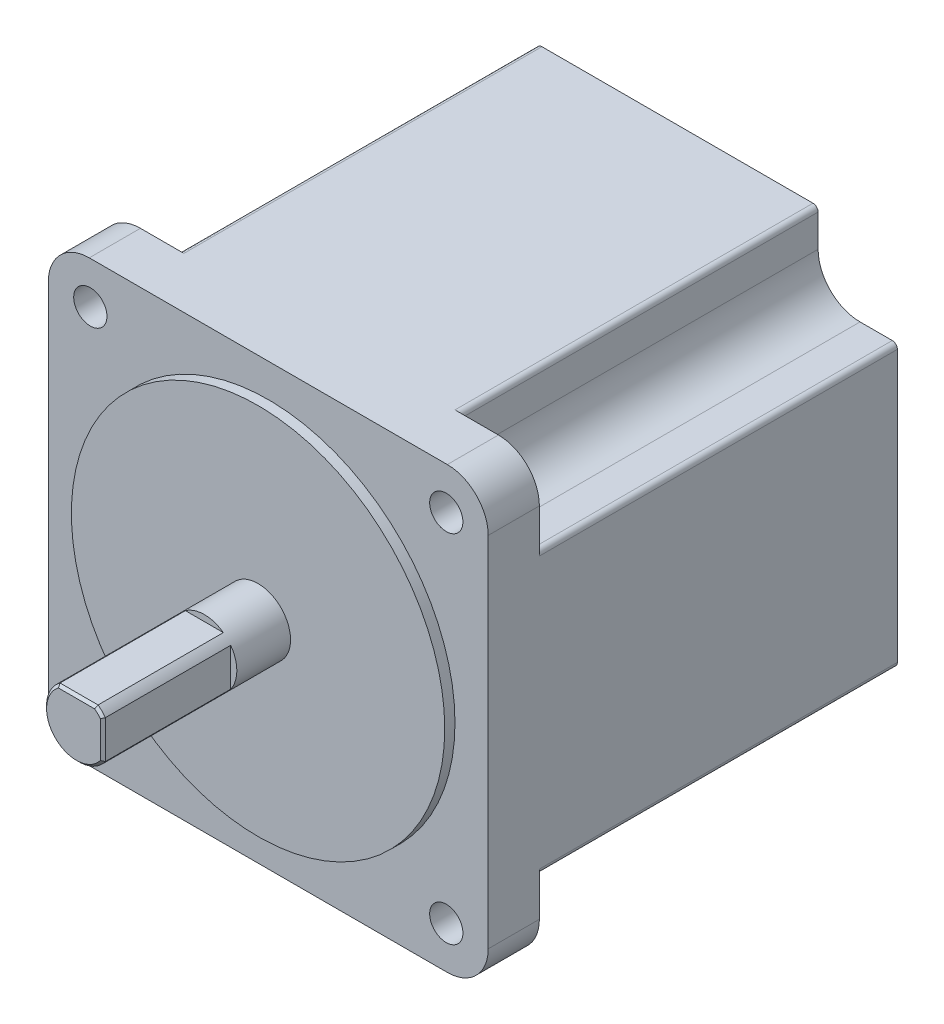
ISO-10303-21;
HEADER;
FILE_DESCRIPTION(('STEP AP214'),'2;1');
FILE_NAME('part.step','',(''),(''),'','','');
FILE_SCHEMA(('AUTOMOTIVE_DESIGN { 1 0 10303 214 1 1 1 1 }'));
ENDSEC;
DATA;
#1=APPLICATION_CONTEXT('core data for automotive mechanical design processes');
#2=APPLICATION_PROTOCOL_DEFINITION('international standard','automotive_design',2000,#1);
#3=PRODUCT_CONTEXT('',#1,'mechanical');
#4=PRODUCT('Part','Part','',(#3));
#5=PRODUCT_RELATED_PRODUCT_CATEGORY('part','',(#4));
#6=PRODUCT_DEFINITION_FORMATION('','',#4);
#7=PRODUCT_DEFINITION_CONTEXT('part definition',#1,'design');
#8=PRODUCT_DEFINITION('design','',#6,#7);
#9=PRODUCT_DEFINITION_SHAPE('','',#8);
#10=(LENGTH_UNIT() NAMED_UNIT(*) SI_UNIT(.MILLI.,.METRE.));
#11=(NAMED_UNIT(*) PLANE_ANGLE_UNIT() SI_UNIT($,.RADIAN.));
#12=(NAMED_UNIT(*) SI_UNIT($,.STERADIAN.) SOLID_ANGLE_UNIT());
#13=UNCERTAINTY_MEASURE_WITH_UNIT(LENGTH_MEASURE(1.E-05),#10,'distance_accuracy_value','');
#14=(GEOMETRIC_REPRESENTATION_CONTEXT(3) GLOBAL_UNCERTAINTY_ASSIGNED_CONTEXT((#13)) GLOBAL_UNIT_ASSIGNED_CONTEXT((#10,
#11,#12)) REPRESENTATION_CONTEXT('',''));
#15=CARTESIAN_POINT('',(0.,0.,0.));
#16=DIRECTION('',(0.,0.,1.));
#17=DIRECTION('',(1.,0.,0.));
#18=AXIS2_PLACEMENT_3D('',#15,#16,#17);
#19=CARTESIAN_POINT('',(35.,-35.,-82.));
#20=DIRECTION('',(0.,0.,1.));
#21=DIRECTION('',(1.,0.,0.));
#22=AXIS2_PLACEMENT_3D('',#19,#20,#21);
#23=CYLINDRICAL_SURFACE('',#22,8.);
#24=CARTESIAN_POINT('',(35.,-35.,-12.));
#25=DIRECTION('',(0.,0.,-1.));
#26=DIRECTION('',(-1.,0.,0.));
#27=AXIS2_PLACEMENT_3D('',#24,#25,#26);
#28=CIRCLE('',#27,8.);
#29=CARTESIAN_POINT('',(43.,-35.,-12.));
#30=VERTEX_POINT('',#29);
#31=CARTESIAN_POINT('',(34.9999999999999,-43.,-12.));
#32=VERTEX_POINT('',#31);
#33=EDGE_CURVE('E341',#30,#32,#28,.T.);
#34=ORIENTED_EDGE('',*,*,#33,.F.);
#35=DIRECTION('',(0.,0.,1.));
#36=VECTOR('',#35,1.);
#37=CARTESIAN_POINT('',(43.,-35.,-82.));
#38=LINE('',#37,#36);
#39=CARTESIAN_POINT('',(43.,-35.,-2.));
#40=VERTEX_POINT('',#39);
#41=EDGE_CURVE('E520',#30,#40,#38,.T.);
#42=ORIENTED_EDGE('',*,*,#41,.T.);
#43=CARTESIAN_POINT('',(35.,-35.,-2.));
#44=DIRECTION('',(0.,0.,-1.));
#45=DIRECTION('',(1.,0.,0.));
#46=AXIS2_PLACEMENT_3D('',#43,#44,#45);
#47=CIRCLE('',#46,8.);
#48=CARTESIAN_POINT('',(34.9999999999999,-43.,-2.));
#49=VERTEX_POINT('',#48);
#50=EDGE_CURVE('E510',#40,#49,#47,.T.);
#51=ORIENTED_EDGE('',*,*,#50,.T.);
#52=DIRECTION('',(0.,0.,1.));
#53=VECTOR('',#52,1.);
#54=CARTESIAN_POINT('',(34.9999999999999,-43.,-82.));
#55=LINE('',#54,#53);
#56=EDGE_CURVE('E556',#32,#49,#55,.T.);
#57=ORIENTED_EDGE('',*,*,#56,.F.);
#58=EDGE_LOOP('',(#34,#42,#51,#57));
#59=FACE_BOUND('',#58,.T.);
#60=ADVANCED_FACE('F35',(#59),#23,.T.);
#61=CARTESIAN_POINT('',(34.8,-34.8,-82.));
#62=DIRECTION('',(0.,0.,1.));
#63=DIRECTION('',(1.,0.,0.));
#64=AXIS2_PLACEMENT_3D('',#61,#62,#63);
#65=CYLINDRICAL_SURFACE('',#64,3.25);
#66=CARTESIAN_POINT('',(34.8,-34.8,-2.));
#67=DIRECTION('',(0.,0.,-1.));
#68=DIRECTION('',(-1.,0.,0.));
#69=AXIS2_PLACEMENT_3D('',#66,#67,#68);
#70=CIRCLE('',#69,3.25);
#71=CARTESIAN_POINT('',(31.55,-34.8,-2.));
#72=VERTEX_POINT('',#71);
#73=EDGE_CURVE('E498',#72,#72,#70,.T.);
#74=ORIENTED_EDGE('',*,*,#73,.F.);
#75=EDGE_LOOP('',(#74));
#76=FACE_BOUND('',#75,.T.);
#77=CARTESIAN_POINT('',(34.8,-34.8,-12.));
#78=DIRECTION('',(0.,0.,-1.));
#79=DIRECTION('',(-1.,0.,0.));
#80=AXIS2_PLACEMENT_3D('',#77,#78,#79);
#81=CIRCLE('',#80,3.25);
#82=CARTESIAN_POINT('',(31.55,-34.8,-12.));
#83=VERTEX_POINT('',#82);
#84=EDGE_CURVE('E330',#83,#83,#81,.T.);
#85=ORIENTED_EDGE('',*,*,#84,.T.);
#86=EDGE_LOOP('',(#85));
#87=FACE_BOUND('',#86,.T.);
#88=ADVANCED_FACE('F641',(#76,#87),#65,.F.);
#89=CARTESIAN_POINT('',(-35.,-35.,-82.));
#90=DIRECTION('',(0.,0.,1.));
#91=DIRECTION('',(1.,0.,0.));
#92=AXIS2_PLACEMENT_3D('',#89,#90,#91);
#93=CYLINDRICAL_SURFACE('',#92,8.);
#94=CARTESIAN_POINT('',(-35.,-35.,-12.));
#95=DIRECTION('',(0.,0.,-1.));
#96=DIRECTION('',(-1.,0.,0.));
#97=AXIS2_PLACEMENT_3D('',#94,#95,#96);
#98=CIRCLE('',#97,8.);
#99=CARTESIAN_POINT('',(-35.,-43.,-12.));
#100=VERTEX_POINT('',#99);
#101=CARTESIAN_POINT('',(-43.,-34.9999999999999,-12.));
#102=VERTEX_POINT('',#101);
#103=EDGE_CURVE('E391',#100,#102,#98,.T.);
#104=ORIENTED_EDGE('',*,*,#103,.F.);
#105=DIRECTION('',(0.,0.,1.));
#106=VECTOR('',#105,1.);
#107=CARTESIAN_POINT('',(-35.,-43.,-82.));
#108=LINE('',#107,#106);
#109=CARTESIAN_POINT('',(-35.,-43.,-2.));
#110=VERTEX_POINT('',#109);
#111=EDGE_CURVE('E554',#100,#110,#108,.T.);
#112=ORIENTED_EDGE('',*,*,#111,.T.);
#113=CARTESIAN_POINT('',(-35.,-35.,-2.));
#114=DIRECTION('',(0.,0.,-1.));
#115=DIRECTION('',(1.,0.,0.));
#116=AXIS2_PLACEMENT_3D('',#113,#114,#115);
#117=CIRCLE('',#116,8.);
#118=CARTESIAN_POINT('',(-43.,-34.9999999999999,-2.));
#119=VERTEX_POINT('',#118);
#120=EDGE_CURVE('E526',#110,#119,#117,.T.);
#121=ORIENTED_EDGE('',*,*,#120,.T.);
#122=DIRECTION('',(0.,0.,1.));
#123=VECTOR('',#122,1.);
#124=CARTESIAN_POINT('',(-43.,-34.9999999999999,-82.));
#125=LINE('',#124,#123);
#126=EDGE_CURVE('E552',#102,#119,#125,.T.);
#127=ORIENTED_EDGE('',*,*,#126,.F.);
#128=EDGE_LOOP('',(#104,#112,#121,#127));
#129=FACE_BOUND('',#128,.T.);
#130=ADVANCED_FACE('F647',(#129),#93,.T.);
#131=CARTESIAN_POINT('',(-34.8,-34.8,-82.));
#132=DIRECTION('',(0.,0.,1.));
#133=DIRECTION('',(1.,0.,0.));
#134=AXIS2_PLACEMENT_3D('',#131,#132,#133);
#135=CYLINDRICAL_SURFACE('',#134,3.25);
#136=CARTESIAN_POINT('',(-34.8,-34.8,-2.));
#137=DIRECTION('',(0.,0.,-1.));
#138=DIRECTION('',(-1.,0.,0.));
#139=AXIS2_PLACEMENT_3D('',#136,#137,#138);
#140=CIRCLE('',#139,3.25);
#141=CARTESIAN_POINT('',(-38.05,-34.8,-2.));
#142=VERTEX_POINT('',#141);
#143=EDGE_CURVE('E501',#142,#142,#140,.T.);
#144=ORIENTED_EDGE('',*,*,#143,.F.);
#145=EDGE_LOOP('',(#144));
#146=FACE_BOUND('',#145,.T.);
#147=CARTESIAN_POINT('',(-34.8,-34.8,-12.));
#148=DIRECTION('',(0.,0.,-1.));
#149=DIRECTION('',(-1.,0.,0.));
#150=AXIS2_PLACEMENT_3D('',#147,#148,#149);
#151=CIRCLE('',#150,3.25);
#152=CARTESIAN_POINT('',(-38.05,-34.8,-12.));
#153=VERTEX_POINT('',#152);
#154=EDGE_CURVE('E378',#153,#153,#151,.T.);
#155=ORIENTED_EDGE('',*,*,#154,.T.);
#156=EDGE_LOOP('',(#155));
#157=FACE_BOUND('',#156,.T.);
#158=ADVANCED_FACE('F807',(#146,#157),#135,.F.);
#159=CARTESIAN_POINT('',(35.,35.,-82.));
#160=DIRECTION('',(0.,0.,1.));
#161=DIRECTION('',(1.,0.,0.));
#162=AXIS2_PLACEMENT_3D('',#159,#160,#161);
#163=CYLINDRICAL_SURFACE('',#162,8.);
#164=CARTESIAN_POINT('',(35.,35.,-12.));
#165=DIRECTION('',(0.,0.,-1.));
#166=DIRECTION('',(-1.,0.,0.));
#167=AXIS2_PLACEMENT_3D('',#164,#165,#166);
#168=CIRCLE('',#167,8.);
#169=CARTESIAN_POINT('',(34.9999999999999,43.,-12.));
#170=VERTEX_POINT('',#169);
#171=CARTESIAN_POINT('',(43.,34.9999999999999,-12.));
#172=VERTEX_POINT('',#171);
#173=EDGE_CURVE('E441',#170,#172,#168,.T.);
#174=ORIENTED_EDGE('',*,*,#173,.F.);
#175=DIRECTION('',(0.,0.,1.));
#176=VECTOR('',#175,1.);
#177=CARTESIAN_POINT('',(34.9999999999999,43.,-82.));
#178=LINE('',#177,#176);
#179=CARTESIAN_POINT('',(34.9999999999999,43.,-2.));
#180=VERTEX_POINT('',#179);
#181=EDGE_CURVE('E546',#170,#180,#178,.T.);
#182=ORIENTED_EDGE('',*,*,#181,.T.);
#183=CARTESIAN_POINT('',(35.,35.,-2.));
#184=DIRECTION('',(0.,0.,-1.));
#185=DIRECTION('',(1.,0.,0.));
#186=AXIS2_PLACEMENT_3D('',#183,#184,#185);
#187=CIRCLE('',#186,8.);
#188=CARTESIAN_POINT('',(43.,34.9999999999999,-2.));
#189=VERTEX_POINT('',#188);
#190=EDGE_CURVE('E538',#180,#189,#187,.T.);
#191=ORIENTED_EDGE('',*,*,#190,.T.);
#192=DIRECTION('',(0.,0.,1.));
#193=VECTOR('',#192,1.);
#194=CARTESIAN_POINT('',(43.,34.9999999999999,-82.));
#195=LINE('',#194,#193);
#196=EDGE_CURVE('E544',#172,#189,#195,.T.);
#197=ORIENTED_EDGE('',*,*,#196,.F.);
#198=EDGE_LOOP('',(#174,#182,#191,#197));
#199=FACE_BOUND('',#198,.T.);
#200=ADVANCED_FACE('F810',(#199),#163,.T.);
#201=CARTESIAN_POINT('',(34.8,34.8,-82.));
#202=DIRECTION('',(0.,0.,1.));
#203=DIRECTION('',(1.,0.,0.));
#204=AXIS2_PLACEMENT_3D('',#201,#202,#203);
#205=CYLINDRICAL_SURFACE('',#204,3.25);
#206=CARTESIAN_POINT('',(34.8,34.8,-2.));
#207=DIRECTION('',(0.,0.,-1.));
#208=DIRECTION('',(-1.,0.,0.));
#209=AXIS2_PLACEMENT_3D('',#206,#207,#208);
#210=CIRCLE('',#209,3.25);
#211=CARTESIAN_POINT('',(31.55,34.8,-2.));
#212=VERTEX_POINT('',#211);
#213=EDGE_CURVE('E507',#212,#212,#210,.T.);
#214=ORIENTED_EDGE('',*,*,#213,.F.);
#215=EDGE_LOOP('',(#214));
#216=FACE_BOUND('',#215,.T.);
#217=CARTESIAN_POINT('',(34.8,34.8,-12.));
#218=DIRECTION('',(0.,0.,-1.));
#219=DIRECTION('',(-1.,0.,0.));
#220=AXIS2_PLACEMENT_3D('',#217,#218,#219);
#221=CIRCLE('',#220,3.25);
#222=CARTESIAN_POINT('',(31.55,34.8,-12.));
#223=VERTEX_POINT('',#222);
#224=EDGE_CURVE('E428',#223,#223,#221,.T.);
#225=ORIENTED_EDGE('',*,*,#224,.T.);
#226=EDGE_LOOP('',(#225));
#227=FACE_BOUND('',#226,.T.);
#228=ADVANCED_FACE('F682',(#216,#227),#205,.F.);
#229=CARTESIAN_POINT('',(0.,0.,0.));
#230=DIRECTION('',(0.,0.,1.));
#231=DIRECTION('',(1.,0.,0.));
#232=AXIS2_PLACEMENT_3D('',#229,#230,#231);
#233=PLANE('',#232);
#234=CARTESIAN_POINT('',(0.,0.,0.));
#235=DIRECTION('',(0.,0.,1.));
#236=DIRECTION('',(1.,0.,0.));
#237=AXIS2_PLACEMENT_3D('',#234,#235,#236);
#238=CIRCLE('',#237,36.5);
#239=CARTESIAN_POINT('',(36.5,0.,0.));
#240=VERTEX_POINT('',#239);
#241=EDGE_CURVE('E579',#240,#240,#238,.T.);
#242=ORIENTED_EDGE('',*,*,#241,.T.);
#243=EDGE_LOOP('',(#242));
#244=FACE_BOUND('',#243,.T.);
#245=CARTESIAN_POINT('',(0.,0.,0.));
#246=DIRECTION('',(0.,0.,1.));
#247=DIRECTION('',(1.,0.,0.));
#248=AXIS2_PLACEMENT_3D('',#245,#246,#247);
#249=CIRCLE('',#248,6.35);
#250=CARTESIAN_POINT('',(6.35,0.,0.));
#251=VERTEX_POINT('',#250);
#252=EDGE_CURVE('E576',#251,#251,#249,.T.);
#253=ORIENTED_EDGE('',*,*,#252,.F.);
#254=EDGE_LOOP('',(#253));
#255=FACE_BOUND('',#254,.T.);
#256=ADVANCED_FACE('F680',(#244,#255),#233,.T.);
#257=CARTESIAN_POINT('',(0.,0.,-2.));
#258=DIRECTION('',(0.,0.,1.));
#259=DIRECTION('',(1.,0.,0.));
#260=AXIS2_PLACEMENT_3D('',#257,#258,#259);
#261=CYLINDRICAL_SURFACE('',#260,36.5);
#262=CARTESIAN_POINT('',(0.,0.,-2.));
#263=DIRECTION('',(0.,0.,1.));
#264=DIRECTION('',(1.,0.,0.));
#265=AXIS2_PLACEMENT_3D('',#262,#263,#264);
#266=CIRCLE('',#265,36.5);
#267=CARTESIAN_POINT('',(36.5,0.,-2.));
#268=VERTEX_POINT('',#267);
#269=EDGE_CURVE('E558',#268,#268,#266,.F.);
#270=ORIENTED_EDGE('',*,*,#269,.F.);
#271=EDGE_LOOP('',(#270));
#272=FACE_BOUND('',#271,.T.);
#273=ORIENTED_EDGE('',*,*,#241,.F.);
#274=EDGE_LOOP('',(#273));
#275=FACE_BOUND('',#274,.T.);
#276=ADVANCED_FACE('F678',(#272,#275),#261,.T.);
#277=CARTESIAN_POINT('',(0.,0.,35.5));
#278=DIRECTION('',(0.,0.,-1.));
#279=DIRECTION('',(-1.,0.,0.));
#280=AXIS2_PLACEMENT_3D('',#277,#278,#279);
#281=CYLINDRICAL_SURFACE('',#280,6.35);
#282=DIRECTION('',(0.,0.,-1.));
#283=VECTOR('',#282,1.);
#284=CARTESIAN_POINT('',(5.15,-3.71483512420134,35.5));
#285=LINE('',#284,#283);
#286=CARTESIAN_POINT('',(5.15,-3.71483512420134,10.5));
#287=VERTEX_POINT('',#286);
#288=CARTESIAN_POINT('',(5.15,-3.71483512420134,35.));
#289=VERTEX_POINT('',#288);
#290=EDGE_CURVE('E564',#287,#289,#285,.F.);
#291=ORIENTED_EDGE('',*,*,#290,.T.);
#292=CARTESIAN_POINT('',(0.,0.,35.));
#293=DIRECTION('',(0.,0.,1.));
#294=DIRECTION('',(1.,0.,0.));
#295=AXIS2_PLACEMENT_3D('',#292,#293,#294);
#296=CIRCLE('',#295,6.35);
#297=CARTESIAN_POINT('',(-3.71483512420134,5.15,35.));
#298=VERTEX_POINT('',#297);
#299=EDGE_CURVE('E607',#289,#298,#296,.F.);
#300=ORIENTED_EDGE('',*,*,#299,.T.);
#301=DIRECTION('',(0.,0.,-1.));
#302=VECTOR('',#301,1.);
#303=CARTESIAN_POINT('',(-3.71483512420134,5.15,35.5));
#304=LINE('',#303,#302);
#305=CARTESIAN_POINT('',(-3.71483512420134,5.15,10.5));
#306=VERTEX_POINT('',#305);
#307=EDGE_CURVE('E574',#298,#306,#304,.T.);
#308=ORIENTED_EDGE('',*,*,#307,.T.);
#309=CARTESIAN_POINT('',(0.,0.,10.5));
#310=DIRECTION('',(0.,0.,1.));
#311=DIRECTION('',(1.,0.,0.));
#312=AXIS2_PLACEMENT_3D('',#309,#310,#311);
#313=CIRCLE('',#312,6.35);
#314=CARTESIAN_POINT('',(3.71483512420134,5.15,10.5));
#315=VERTEX_POINT('',#314);
#316=EDGE_CURVE('E582',#315,#306,#313,.T.);
#317=ORIENTED_EDGE('',*,*,#316,.F.);
#318=DIRECTION('',(0.,0.,-1.));
#319=VECTOR('',#318,1.);
#320=CARTESIAN_POINT('',(3.71483512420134,5.15,35.5));
#321=LINE('',#320,#319);
#322=CARTESIAN_POINT('',(3.71483512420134,5.15,35.));
#323=VERTEX_POINT('',#322);
#324=EDGE_CURVE('E572',#315,#323,#321,.F.);
#325=ORIENTED_EDGE('',*,*,#324,.T.);
#326=CARTESIAN_POINT('',(0.,0.,35.));
#327=DIRECTION('',(0.,0.,1.));
#328=DIRECTION('',(1.,0.,0.));
#329=AXIS2_PLACEMENT_3D('',#326,#327,#328);
#330=CIRCLE('',#329,6.35);
#331=CARTESIAN_POINT('',(5.15,3.71483512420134,35.));
#332=VERTEX_POINT('',#331);
#333=EDGE_CURVE('E605',#323,#332,#330,.F.);
#334=ORIENTED_EDGE('',*,*,#333,.T.);
#335=DIRECTION('',(0.,0.,-1.));
#336=VECTOR('',#335,1.);
#337=CARTESIAN_POINT('',(5.15,3.71483512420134,35.5));
#338=LINE('',#337,#336);
#339=CARTESIAN_POINT('',(5.15,3.71483512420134,10.5));
#340=VERTEX_POINT('',#339);
#341=EDGE_CURVE('E567',#332,#340,#338,.T.);
#342=ORIENTED_EDGE('',*,*,#341,.T.);
#343=CARTESIAN_POINT('',(0.,0.,10.5));
#344=DIRECTION('',(0.,0.,1.));
#345=DIRECTION('',(1.,0.,0.));
#346=AXIS2_PLACEMENT_3D('',#343,#344,#345);
#347=CIRCLE('',#346,6.35);
#348=EDGE_CURVE('E585',#287,#340,#347,.T.);
#349=ORIENTED_EDGE('',*,*,#348,.F.);
#350=EDGE_LOOP('',(#291,#300,#308,#317,#325,#334,#342,#349));
#351=FACE_BOUND('',#350,.T.);
#352=ORIENTED_EDGE('',*,*,#252,.T.);
#353=EDGE_LOOP('',(#352));
#354=FACE_BOUND('',#353,.T.);
#355=ADVANCED_FACE('F674',(#351,#354),#281,.T.);
#356=CARTESIAN_POINT('',(0.,0.,35.5));
#357=DIRECTION('',(0.,0.,1.));
#358=DIRECTION('',(1.,0.,0.));
#359=AXIS2_PLACEMENT_3D('',#356,#357,#358);
#360=PLANE('',#359);
#361=DIRECTION('',(-1.,0.,0.));
#362=VECTOR('',#361,1.);
#363=CARTESIAN_POINT('',(-3.71483512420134,4.64999999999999,35.5));
#364=LINE('',#363,#362);
#365=CARTESIAN_POINT('',(3.54964786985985,4.64999999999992,35.5));
#366=VERTEX_POINT('',#365);
#367=CARTESIAN_POINT('',(-3.54964786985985,4.64999999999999,35.5));
#368=VERTEX_POINT('',#367);
#369=EDGE_CURVE('E600',#366,#368,#364,.T.);
#370=ORIENTED_EDGE('',*,*,#369,.T.);
#371=CARTESIAN_POINT('',(0.,0.,35.5));
#372=DIRECTION('',(0.,0.,1.));
#373=DIRECTION('',(1.,0.,0.));
#374=AXIS2_PLACEMENT_3D('',#371,#372,#373);
#375=CIRCLE('',#374,5.84999999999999);
#376=CARTESIAN_POINT('',(4.64999999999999,-3.54964786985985,35.5));
#377=VERTEX_POINT('',#376);
#378=EDGE_CURVE('E602',#368,#377,#375,.T.);
#379=ORIENTED_EDGE('',*,*,#378,.T.);
#380=DIRECTION('',(0.,1.,0.));
#381=VECTOR('',#380,1.);
#382=CARTESIAN_POINT('',(4.64999999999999,3.71483512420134,35.5));
#383=LINE('',#382,#381);
#384=CARTESIAN_POINT('',(4.64999999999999,3.54964786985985,35.5));
#385=VERTEX_POINT('',#384);
#386=EDGE_CURVE('E588',#377,#385,#383,.T.);
#387=ORIENTED_EDGE('',*,*,#386,.T.);
#388=CARTESIAN_POINT('',(0.,0.,35.5));
#389=DIRECTION('',(0.,0.,1.));
#390=DIRECTION('',(1.,0.,0.));
#391=AXIS2_PLACEMENT_3D('',#388,#389,#390);
#392=CIRCLE('',#391,5.84999999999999);
#393=EDGE_CURVE('E598',#385,#366,#392,.T.);
#394=ORIENTED_EDGE('',*,*,#393,.T.);
#395=EDGE_LOOP('',(#370,#379,#387,#394));
#396=FACE_BOUND('',#395,.T.);
#397=ADVANCED_FACE('F668',(#396),#360,.T.);
#398=CARTESIAN_POINT('',(0.,0.,10.5));
#399=DIRECTION('',(0.,0.,1.));
#400=DIRECTION('',(1.,0.,0.));
#401=AXIS2_PLACEMENT_3D('',#398,#399,#400);
#402=PLANE('',#401);
#403=ORIENTED_EDGE('',*,*,#316,.T.);
#404=DIRECTION('',(1.,0.,0.));
#405=VECTOR('',#404,1.);
#406=CARTESIAN_POINT('',(-5.401405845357,5.15,10.5));
#407=LINE('',#406,#405);
#408=EDGE_CURVE('E569',#306,#315,#407,.T.);
#409=ORIENTED_EDGE('',*,*,#408,.T.);
#410=EDGE_LOOP('',(#403,#409));
#411=FACE_BOUND('',#410,.T.);
#412=ADVANCED_FACE('F665',(#411),#402,.T.);
#413=CARTESIAN_POINT('',(0.,5.15,10.5));
#414=DIRECTION('',(0.,-1.,0.));
#415=DIRECTION('',(0.,0.,-1.));
#416=AXIS2_PLACEMENT_3D('',#413,#414,#415);
#417=PLANE('',#416);
#418=ORIENTED_EDGE('',*,*,#307,.F.);
#419=DIRECTION('',(1.,0.,0.));
#420=VECTOR('',#419,1.);
#421=CARTESIAN_POINT('',(3.71483512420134,5.15,35.));
#422=LINE('',#421,#420);
#423=EDGE_CURVE('E48',#298,#323,#422,.T.);
#424=ORIENTED_EDGE('',*,*,#423,.T.);
#425=ORIENTED_EDGE('',*,*,#324,.F.);
#426=ORIENTED_EDGE('',*,*,#408,.F.);
#427=EDGE_LOOP('',(#418,#424,#425,#426));
#428=FACE_BOUND('',#427,.T.);
#429=ADVANCED_FACE('F659',(#428),#417,.F.);
#430=CARTESIAN_POINT('',(0.,0.,10.5));
#431=DIRECTION('',(0.,0.,1.));
#432=DIRECTION('',(1.,0.,0.));
#433=AXIS2_PLACEMENT_3D('',#430,#431,#432);
#434=PLANE('',#433);
#435=ORIENTED_EDGE('',*,*,#348,.T.);
#436=DIRECTION('',(0.,-1.,0.));
#437=VECTOR('',#436,1.);
#438=CARTESIAN_POINT('',(5.15,4.40641003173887,10.5));
#439=LINE('',#438,#437);
#440=EDGE_CURVE('E561',#340,#287,#439,.T.);
#441=ORIENTED_EDGE('',*,*,#440,.T.);
#442=EDGE_LOOP('',(#435,#441));
#443=FACE_BOUND('',#442,.T.);
#444=ADVANCED_FACE('F655',(#443),#434,.T.);
#445=CARTESIAN_POINT('',(5.15,0.,10.5));
#446=DIRECTION('',(-1.,0.,0.));
#447=DIRECTION('',(0.,0.,1.));
#448=AXIS2_PLACEMENT_3D('',#445,#446,#447);
#449=PLANE('',#448);
#450=ORIENTED_EDGE('',*,*,#341,.F.);
#451=DIRECTION('',(0.,-1.,0.));
#452=VECTOR('',#451,1.);
#453=CARTESIAN_POINT('',(5.15,-3.71483512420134,35.));
#454=LINE('',#453,#452);
#455=EDGE_CURVE('E11',#332,#289,#454,.T.);
#456=ORIENTED_EDGE('',*,*,#455,.T.);
#457=ORIENTED_EDGE('',*,*,#290,.F.);
#458=ORIENTED_EDGE('',*,*,#440,.F.);
#459=EDGE_LOOP('',(#450,#456,#457,#458));
#460=FACE_BOUND('',#459,.T.);
#461=ADVANCED_FACE('F658',(#460),#449,.F.);
#462=CARTESIAN_POINT('',(35.,-35.,-82.));
#463=DIRECTION('',(0.,0.,1.));
#464=DIRECTION('',(1.,0.,0.));
#465=AXIS2_PLACEMENT_3D('',#462,#463,#464);
#466=PLANE('',#465);
#467=DIRECTION('',(0.,1.,0.));
#468=VECTOR('',#467,1.);
#469=CARTESIAN_POINT('',(27.5,-42.,-82.));
#470=LINE('',#469,#468);
#471=CARTESIAN_POINT('',(27.5,-42.,-82.));
#472=VERTEX_POINT('',#471);
#473=CARTESIAN_POINT('',(27.5,-35.7000000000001,-82.));
#474=VERTEX_POINT('',#473);
#475=EDGE_CURVE('E310',#472,#474,#470,.T.);
#476=ORIENTED_EDGE('',*,*,#475,.F.);
#477=CARTESIAN_POINT('',(26.5,-42.,-82.));
#478=DIRECTION('',(0.,0.,1.));
#479=DIRECTION('',(1.,0.,0.));
#480=AXIS2_PLACEMENT_3D('',#477,#478,#479);
#481=CIRCLE('',#480,0.999999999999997);
#482=CARTESIAN_POINT('',(26.5,-43.,-82.));
#483=VERTEX_POINT('',#482);
#484=EDGE_CURVE('E313',#483,#472,#481,.T.);
#485=ORIENTED_EDGE('',*,*,#484,.F.);
#486=DIRECTION('',(-1.,0.,0.));
#487=VECTOR('',#486,1.);
#488=CARTESIAN_POINT('',(-35.,-43.,-82.));
#489=LINE('',#488,#487);
#490=CARTESIAN_POINT('',(-26.5,-43.,-82.));
#491=VERTEX_POINT('',#490);
#492=EDGE_CURVE('E511',#483,#491,#489,.T.);
#493=ORIENTED_EDGE('',*,*,#492,.T.);
#494=CARTESIAN_POINT('',(-26.5,-42.,-82.));
#495=DIRECTION('',(0.,0.,1.));
#496=DIRECTION('',(-1.,0.,0.));
#497=AXIS2_PLACEMENT_3D('',#494,#495,#496);
#498=CIRCLE('',#497,1.);
#499=CARTESIAN_POINT('',(-27.5,-42.,-82.));
#500=VERTEX_POINT('',#499);
#501=EDGE_CURVE('E345',#500,#491,#498,.T.);
#502=ORIENTED_EDGE('',*,*,#501,.F.);
#503=DIRECTION('',(0.,-1.,0.));
#504=VECTOR('',#503,1.);
#505=CARTESIAN_POINT('',(-27.5,-42.,-82.));
#506=LINE('',#505,#504);
#507=CARTESIAN_POINT('',(-27.5,-35.7000000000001,-82.));
#508=VERTEX_POINT('',#507);
#509=EDGE_CURVE('E350',#508,#500,#506,.T.);
#510=ORIENTED_EDGE('',*,*,#509,.F.);
#511=CARTESIAN_POINT('',(-35.7,-35.7,-82.));
#512=DIRECTION('',(0.,0.,-1.));
#513=DIRECTION('',(1.,0.,0.));
#514=AXIS2_PLACEMENT_3D('',#511,#512,#513);
#515=CIRCLE('',#514,8.19999999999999);
#516=CARTESIAN_POINT('',(-35.7,-27.5,-82.));
#517=VERTEX_POINT('',#516);
#518=EDGE_CURVE('E371',#517,#508,#515,.T.);
#519=ORIENTED_EDGE('',*,*,#518,.F.);
#520=DIRECTION('',(1.,0.,0.));
#521=VECTOR('',#520,1.);
#522=CARTESIAN_POINT('',(-35.7,-27.5,-82.));
#523=LINE('',#522,#521);
#524=CARTESIAN_POINT('',(-42.,-27.5,-82.));
#525=VERTEX_POINT('',#524);
#526=EDGE_CURVE('E368',#525,#517,#523,.T.);
#527=ORIENTED_EDGE('',*,*,#526,.F.);
#528=CARTESIAN_POINT('',(-42.,-26.5,-82.));
#529=DIRECTION('',(0.,0.,1.));
#530=DIRECTION('',(-1.,0.,0.));
#531=AXIS2_PLACEMENT_3D('',#528,#529,#530);
#532=CIRCLE('',#531,1.);
#533=CARTESIAN_POINT('',(-43.,-26.5,-82.));
#534=VERTEX_POINT('',#533);
#535=EDGE_CURVE('E365',#534,#525,#532,.T.);
#536=ORIENTED_EDGE('',*,*,#535,.F.);
#537=DIRECTION('',(0.,1.,0.));
#538=VECTOR('',#537,1.);
#539=CARTESIAN_POINT('',(-43.,34.9999999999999,-82.));
#540=LINE('',#539,#538);
#541=CARTESIAN_POINT('',(-43.,26.5,-82.));
#542=VERTEX_POINT('',#541);
#543=EDGE_CURVE('E513',#534,#542,#540,.T.);
#544=ORIENTED_EDGE('',*,*,#543,.T.);
#545=CARTESIAN_POINT('',(-42.,26.5,-82.));
#546=DIRECTION('',(0.,0.,1.));
#547=DIRECTION('',(1.,0.,0.));
#548=AXIS2_PLACEMENT_3D('',#545,#546,#547);
#549=CIRCLE('',#548,1.);
#550=CARTESIAN_POINT('',(-42.,27.5,-82.));
#551=VERTEX_POINT('',#550);
#552=EDGE_CURVE('E450',#551,#542,#549,.T.);
#553=ORIENTED_EDGE('',*,*,#552,.F.);
#554=DIRECTION('',(-1.,0.,0.));
#555=VECTOR('',#554,1.);
#556=CARTESIAN_POINT('',(-35.7000000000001,27.5,-82.));
#557=LINE('',#556,#555);
#558=CARTESIAN_POINT('',(-35.7000000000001,27.5,-82.));
#559=VERTEX_POINT('',#558);
#560=EDGE_CURVE('E471',#559,#551,#557,.T.);
#561=ORIENTED_EDGE('',*,*,#560,.F.);
#562=CARTESIAN_POINT('',(-35.7,35.7,-82.));
#563=DIRECTION('',(0.,0.,-1.));
#564=DIRECTION('',(-1.,0.,0.));
#565=AXIS2_PLACEMENT_3D('',#562,#563,#564);
#566=CIRCLE('',#565,8.2);
#567=CARTESIAN_POINT('',(-27.5,35.7000000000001,-82.));
#568=VERTEX_POINT('',#567);
#569=EDGE_CURVE('E468',#568,#559,#566,.T.);
#570=ORIENTED_EDGE('',*,*,#569,.F.);
#571=DIRECTION('',(0.,-1.,0.));
#572=VECTOR('',#571,1.);
#573=CARTESIAN_POINT('',(-27.5,42.,-82.));
#574=LINE('',#573,#572);
#575=CARTESIAN_POINT('',(-27.5,42.,-82.));
#576=VERTEX_POINT('',#575);
#577=EDGE_CURVE('E465',#576,#568,#574,.T.);
#578=ORIENTED_EDGE('',*,*,#577,.F.);
#579=CARTESIAN_POINT('',(-26.5,42.,-82.));
#580=DIRECTION('',(0.,0.,1.));
#581=DIRECTION('',(1.,0.,0.));
#582=AXIS2_PLACEMENT_3D('',#579,#580,#581);
#583=CIRCLE('',#582,1.);
#584=CARTESIAN_POINT('',(-26.5,43.,-82.));
#585=VERTEX_POINT('',#584);
#586=EDGE_CURVE('E445',#585,#576,#583,.T.);
#587=ORIENTED_EDGE('',*,*,#586,.F.);
#588=DIRECTION('',(1.,0.,0.));
#589=VECTOR('',#588,1.);
#590=CARTESIAN_POINT('',(0.,43.,-82.));
#591=LINE('',#590,#589);
#592=CARTESIAN_POINT('',(26.5,43.,-82.));
#593=VERTEX_POINT('',#592);
#594=EDGE_CURVE('E516',#585,#593,#591,.T.);
#595=ORIENTED_EDGE('',*,*,#594,.T.);
#596=CARTESIAN_POINT('',(26.5,42.,-82.));
#597=DIRECTION('',(0.,0.,1.));
#598=DIRECTION('',(-1.,0.,0.));
#599=AXIS2_PLACEMENT_3D('',#596,#597,#598);
#600=CIRCLE('',#599,0.999999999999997);
#601=CARTESIAN_POINT('',(27.5,42.,-82.));
#602=VERTEX_POINT('',#601);
#603=EDGE_CURVE('E395',#602,#593,#600,.T.);
#604=ORIENTED_EDGE('',*,*,#603,.F.);
#605=DIRECTION('',(0.,1.,0.));
#606=VECTOR('',#605,1.);
#607=CARTESIAN_POINT('',(27.5,42.,-82.));
#608=LINE('',#607,#606);
#609=CARTESIAN_POINT('',(27.5,35.7000000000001,-82.));
#610=VERTEX_POINT('',#609);
#611=EDGE_CURVE('E400',#610,#602,#608,.T.);
#612=ORIENTED_EDGE('',*,*,#611,.F.);
#613=CARTESIAN_POINT('',(35.7,35.7,-82.));
#614=DIRECTION('',(0.,0.,-1.));
#615=DIRECTION('',(1.,0.,0.));
#616=AXIS2_PLACEMENT_3D('',#613,#614,#615);
#617=CIRCLE('',#616,8.2);
#618=CARTESIAN_POINT('',(35.7,27.5,-82.));
#619=VERTEX_POINT('',#618);
#620=EDGE_CURVE('E421',#619,#610,#617,.T.);
#621=ORIENTED_EDGE('',*,*,#620,.F.);
#622=DIRECTION('',(-1.,0.,0.));
#623=VECTOR('',#622,1.);
#624=CARTESIAN_POINT('',(35.7,27.5,-82.));
#625=LINE('',#624,#623);
#626=CARTESIAN_POINT('',(42.,27.5,-82.));
#627=VERTEX_POINT('',#626);
#628=EDGE_CURVE('E418',#627,#619,#625,.T.);
#629=ORIENTED_EDGE('',*,*,#628,.F.);
#630=CARTESIAN_POINT('',(42.,26.5,-82.));
#631=DIRECTION('',(0.,0.,1.));
#632=DIRECTION('',(-1.,0.,0.));
#633=AXIS2_PLACEMENT_3D('',#630,#631,#632);
#634=CIRCLE('',#633,1.);
#635=CARTESIAN_POINT('',(43.,26.5,-82.));
#636=VERTEX_POINT('',#635);
#637=EDGE_CURVE('E415',#636,#627,#634,.T.);
#638=ORIENTED_EDGE('',*,*,#637,.F.);
#639=DIRECTION('',(0.,-1.,0.));
#640=VECTOR('',#639,1.);
#641=CARTESIAN_POINT('',(43.,-35.,-82.));
#642=LINE('',#641,#640);
#643=CARTESIAN_POINT('',(43.,-26.5,-82.));
#644=VERTEX_POINT('',#643);
#645=EDGE_CURVE('E518',#636,#644,#642,.T.);
#646=ORIENTED_EDGE('',*,*,#645,.T.);
#647=CARTESIAN_POINT('',(42.,-26.5,-82.));
#648=DIRECTION('',(0.,0.,1.));
#649=DIRECTION('',(1.,0.,0.));
#650=AXIS2_PLACEMENT_3D('',#647,#648,#649);
#651=CIRCLE('',#650,1.);
#652=CARTESIAN_POINT('',(42.,-27.5,-82.));
#653=VERTEX_POINT('',#652);
#654=EDGE_CURVE('E323',#653,#644,#651,.T.);
#655=ORIENTED_EDGE('',*,*,#654,.F.);
#656=DIRECTION('',(1.,0.,0.));
#657=VECTOR('',#656,1.);
#658=CARTESIAN_POINT('',(35.7,-27.5,-82.));
#659=LINE('',#658,#657);
#660=CARTESIAN_POINT('',(35.7,-27.5,-82.));
#661=VERTEX_POINT('',#660);
#662=EDGE_CURVE('E321',#661,#653,#659,.T.);
#663=ORIENTED_EDGE('',*,*,#662,.F.);
#664=CARTESIAN_POINT('',(35.7,-35.7,-82.));
#665=DIRECTION('',(0.,0.,-1.));
#666=DIRECTION('',(-1.,0.,0.));
#667=AXIS2_PLACEMENT_3D('',#664,#665,#666);
#668=CIRCLE('',#667,8.19999999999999);
#669=EDGE_CURVE('E293',#474,#661,#668,.T.);
#670=ORIENTED_EDGE('',*,*,#669,.F.);
#671=EDGE_LOOP('',(#476,#485,#493,#502,#510,#519,#527,#536,#544,#553,#561,#570,#578,#587,#595,
#604,#612,#621,#629,#638,#646,#655,#663,#670));
#672=FACE_BOUND('',#671,.T.);
#673=ADVANCED_FACE('F663',(#672),#466,.F.);
#674=CARTESIAN_POINT('',(35.,-35.,-2.));
#675=DIRECTION('',(0.,0.,1.));
#676=DIRECTION('',(1.,0.,0.));
#677=AXIS2_PLACEMENT_3D('',#674,#675,#676);
#678=PLANE('',#677);
#679=ORIENTED_EDGE('',*,*,#269,.T.);
#680=EDGE_LOOP('',(#679));
#681=FACE_BOUND('',#680,.T.);
#682=ORIENTED_EDGE('',*,*,#143,.T.);
#683=EDGE_LOOP('',(#682));
#684=FACE_BOUND('',#683,.T.);
#685=ORIENTED_EDGE('',*,*,#213,.T.);
#686=EDGE_LOOP('',(#685));
#687=FACE_BOUND('',#686,.T.);
#688=ORIENTED_EDGE('',*,*,#50,.F.);
#689=DIRECTION('',(0.,-1.,0.));
#690=VECTOR('',#689,1.);
#691=CARTESIAN_POINT('',(43.,-35.,-2.));
#692=LINE('',#691,#690);
#693=EDGE_CURVE('E514',#189,#40,#692,.T.);
#694=ORIENTED_EDGE('',*,*,#693,.F.);
#695=ORIENTED_EDGE('',*,*,#190,.F.);
#696=DIRECTION('',(1.,0.,0.));
#697=VECTOR('',#696,1.);
#698=CARTESIAN_POINT('',(34.9999999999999,43.,-2.));
#699=LINE('',#698,#697);
#700=CARTESIAN_POINT('',(-34.9999999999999,43.,-2.));
#701=VERTEX_POINT('',#700);
#702=EDGE_CURVE('E535',#701,#180,#699,.T.);
#703=ORIENTED_EDGE('',*,*,#702,.F.);
#704=CARTESIAN_POINT('',(-35.,35.,-2.));
#705=DIRECTION('',(0.,0.,-1.));
#706=DIRECTION('',(1.,0.,0.));
#707=AXIS2_PLACEMENT_3D('',#704,#705,#706);
#708=CIRCLE('',#707,8.);
#709=CARTESIAN_POINT('',(-43.,34.9999999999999,-2.));
#710=VERTEX_POINT('',#709);
#711=EDGE_CURVE('E532',#710,#701,#708,.T.);
#712=ORIENTED_EDGE('',*,*,#711,.F.);
#713=DIRECTION('',(0.,1.,0.));
#714=VECTOR('',#713,1.);
#715=CARTESIAN_POINT('',(-43.,34.9999999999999,-2.));
#716=LINE('',#715,#714);
#717=EDGE_CURVE('E529',#119,#710,#716,.T.);
#718=ORIENTED_EDGE('',*,*,#717,.F.);
#719=ORIENTED_EDGE('',*,*,#120,.F.);
#720=DIRECTION('',(-1.,0.,0.));
#721=VECTOR('',#720,1.);
#722=CARTESIAN_POINT('',(-35.,-43.,-2.));
#723=LINE('',#722,#721);
#724=EDGE_CURVE('E523',#49,#110,#723,.T.);
#725=ORIENTED_EDGE('',*,*,#724,.F.);
#726=EDGE_LOOP('',(#688,#694,#695,#703,#712,#718,#719,#725));
#727=FACE_BOUND('',#726,.T.);
#728=CARTESIAN_POINT('',(-34.8,34.8,-2.));
#729=DIRECTION('',(0.,0.,-1.));
#730=DIRECTION('',(-1.,0.,0.));
#731=AXIS2_PLACEMENT_3D('',#728,#729,#730);
#732=CIRCLE('',#731,3.25);
#733=CARTESIAN_POINT('',(-38.05,34.8,-2.));
#734=VERTEX_POINT('',#733);
#735=EDGE_CURVE('E504',#734,#734,#732,.T.);
#736=ORIENTED_EDGE('',*,*,#735,.T.);
#737=EDGE_LOOP('',(#736));
#738=FACE_BOUND('',#737,.T.);
#739=ORIENTED_EDGE('',*,*,#73,.T.);
#740=EDGE_LOOP('',(#739));
#741=FACE_BOUND('',#740,.T.);
#742=ADVANCED_FACE('F695',(#681,#684,#687,#727,#738,#741),#678,.T.);
#743=CARTESIAN_POINT('',(-35.,-43.,-82.));
#744=DIRECTION('',(0.,1.,0.));
#745=DIRECTION('',(-1.,0.,0.));
#746=AXIS2_PLACEMENT_3D('',#743,#744,#745);
#747=PLANE('',#746);
#748=DIRECTION('',(0.,0.,-1.));
#749=VECTOR('',#748,1.);
#750=CARTESIAN_POINT('',(-26.5,-43.,-12.));
#751=LINE('',#750,#749);
#752=CARTESIAN_POINT('',(-26.5,-43.,-12.));
#753=VERTEX_POINT('',#752);
#754=EDGE_CURVE('E362',#753,#491,#751,.T.);
#755=ORIENTED_EDGE('',*,*,#754,.T.);
#756=ORIENTED_EDGE('',*,*,#492,.F.);
#757=DIRECTION('',(0.,0.,-1.));
#758=VECTOR('',#757,1.);
#759=CARTESIAN_POINT('',(26.5,-43.,-12.));
#760=LINE('',#759,#758);
#761=CARTESIAN_POINT('',(26.5,-43.,-12.));
#762=VERTEX_POINT('',#761);
#763=EDGE_CURVE('E333',#762,#483,#760,.T.);
#764=ORIENTED_EDGE('',*,*,#763,.F.);
#765=DIRECTION('',(-1.,0.,0.));
#766=VECTOR('',#765,1.);
#767=CARTESIAN_POINT('',(-35.,-43.,-12.));
#768=LINE('',#767,#766);
#769=EDGE_CURVE('E343',#32,#762,#768,.T.);
#770=ORIENTED_EDGE('',*,*,#769,.F.);
#771=ORIENTED_EDGE('',*,*,#56,.T.);
#772=ORIENTED_EDGE('',*,*,#724,.T.);
#773=ORIENTED_EDGE('',*,*,#111,.F.);
#774=DIRECTION('',(-1.,0.,0.));
#775=VECTOR('',#774,1.);
#776=CARTESIAN_POINT('',(-35.,-43.,-12.));
#777=LINE('',#776,#775);
#778=EDGE_CURVE('E393',#753,#100,#777,.T.);
#779=ORIENTED_EDGE('',*,*,#778,.F.);
#780=EDGE_LOOP('',(#755,#756,#764,#770,#771,#772,#773,#779));
#781=FACE_BOUND('',#780,.T.);
#782=ADVANCED_FACE('F653',(#781),#747,.F.);
#783=CARTESIAN_POINT('',(-43.,34.9999999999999,-82.));
#784=DIRECTION('',(1.,0.,0.));
#785=DIRECTION('',(0.,1.,0.));
#786=AXIS2_PLACEMENT_3D('',#783,#784,#785);
#787=PLANE('',#786);
#788=DIRECTION('',(0.,0.,-1.));
#789=VECTOR('',#788,1.);
#790=CARTESIAN_POINT('',(-43.,26.5,-12.));
#791=LINE('',#790,#789);
#792=CARTESIAN_POINT('',(-43.,26.5,-12.));
#793=VERTEX_POINT('',#792);
#794=EDGE_CURVE('E476',#793,#542,#791,.T.);
#795=ORIENTED_EDGE('',*,*,#794,.T.);
#796=ORIENTED_EDGE('',*,*,#543,.F.);
#797=DIRECTION('',(0.,0.,-1.));
#798=VECTOR('',#797,1.);
#799=CARTESIAN_POINT('',(-43.,-26.5,-12.));
#800=LINE('',#799,#798);
#801=CARTESIAN_POINT('',(-43.,-26.5,-12.));
#802=VERTEX_POINT('',#801);
#803=EDGE_CURVE('E385',#802,#534,#800,.T.);
#804=ORIENTED_EDGE('',*,*,#803,.F.);
#805=DIRECTION('',(0.,1.,0.));
#806=VECTOR('',#805,1.);
#807=CARTESIAN_POINT('',(-43.,34.9999999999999,-12.));
#808=LINE('',#807,#806);
#809=EDGE_CURVE('E389',#102,#802,#808,.T.);
#810=ORIENTED_EDGE('',*,*,#809,.F.);
#811=ORIENTED_EDGE('',*,*,#126,.T.);
#812=ORIENTED_EDGE('',*,*,#717,.T.);
#813=DIRECTION('',(0.,0.,1.));
#814=VECTOR('',#813,1.);
#815=CARTESIAN_POINT('',(-43.,34.9999999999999,-82.));
#816=LINE('',#815,#814);
#817=CARTESIAN_POINT('',(-43.,34.9999999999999,-12.));
#818=VERTEX_POINT('',#817);
#819=EDGE_CURVE('E550',#818,#710,#816,.T.);
#820=ORIENTED_EDGE('',*,*,#819,.F.);
#821=DIRECTION('',(0.,-1.,0.));
#822=VECTOR('',#821,1.);
#823=CARTESIAN_POINT('',(-43.,34.9999999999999,-12.));
#824=LINE('',#823,#822);
#825=EDGE_CURVE('E495',#818,#793,#824,.T.);
#826=ORIENTED_EDGE('',*,*,#825,.T.);
#827=EDGE_LOOP('',(#795,#796,#804,#810,#811,#812,#820,#826));
#828=FACE_BOUND('',#827,.T.);
#829=ADVANCED_FACE('F835',(#828),#787,.F.);
#830=CARTESIAN_POINT('',(-35.,35.,-82.));
#831=DIRECTION('',(0.,0.,1.));
#832=DIRECTION('',(1.,0.,0.));
#833=AXIS2_PLACEMENT_3D('',#830,#831,#832);
#834=CYLINDRICAL_SURFACE('',#833,8.);
#835=DIRECTION('',(0.,0.,1.));
#836=VECTOR('',#835,1.);
#837=CARTESIAN_POINT('',(-34.9999999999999,43.,-82.));
#838=LINE('',#837,#836);
#839=CARTESIAN_POINT('',(-34.9999999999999,43.,-12.));
#840=VERTEX_POINT('',#839);
#841=EDGE_CURVE('E548',#840,#701,#838,.T.);
#842=ORIENTED_EDGE('',*,*,#841,.F.);
#843=CARTESIAN_POINT('',(-35.,35.,-12.));
#844=DIRECTION('',(0.,0.,1.));
#845=DIRECTION('',(1.,0.,0.));
#846=AXIS2_PLACEMENT_3D('',#843,#844,#845);
#847=CIRCLE('',#846,8.);
#848=EDGE_CURVE('E492',#840,#818,#847,.T.);
#849=ORIENTED_EDGE('',*,*,#848,.T.);
#850=ORIENTED_EDGE('',*,*,#819,.T.);
#851=ORIENTED_EDGE('',*,*,#711,.T.);
#852=EDGE_LOOP('',(#842,#849,#850,#851));
#853=FACE_BOUND('',#852,.T.);
#854=ADVANCED_FACE('F831',(#853),#834,.T.);
#855=CARTESIAN_POINT('',(34.9999999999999,43.,-82.));
#856=DIRECTION('',(0.,-1.,0.));
#857=DIRECTION('',(0.,0.,-1.));
#858=AXIS2_PLACEMENT_3D('',#855,#856,#857);
#859=PLANE('',#858);
#860=DIRECTION('',(0.,0.,-1.));
#861=VECTOR('',#860,1.);
#862=CARTESIAN_POINT('',(26.5,43.,-12.));
#863=LINE('',#862,#861);
#864=CARTESIAN_POINT('',(26.5,43.,-12.));
#865=VERTEX_POINT('',#864);
#866=EDGE_CURVE('E412',#865,#593,#863,.T.);
#867=ORIENTED_EDGE('',*,*,#866,.T.);
#868=ORIENTED_EDGE('',*,*,#594,.F.);
#869=DIRECTION('',(0.,0.,-1.));
#870=VECTOR('',#869,1.);
#871=CARTESIAN_POINT('',(-26.5,43.,-12.));
#872=LINE('',#871,#870);
#873=CARTESIAN_POINT('',(-26.5,43.,-12.));
#874=VERTEX_POINT('',#873);
#875=EDGE_CURVE('E462',#874,#585,#872,.T.);
#876=ORIENTED_EDGE('',*,*,#875,.F.);
#877=DIRECTION('',(-1.,0.,0.));
#878=VECTOR('',#877,1.);
#879=CARTESIAN_POINT('',(34.9999999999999,43.,-12.));
#880=LINE('',#879,#878);
#881=EDGE_CURVE('E489',#874,#840,#880,.T.);
#882=ORIENTED_EDGE('',*,*,#881,.T.);
#883=ORIENTED_EDGE('',*,*,#841,.T.);
#884=ORIENTED_EDGE('',*,*,#702,.T.);
#885=ORIENTED_EDGE('',*,*,#181,.F.);
#886=DIRECTION('',(1.,0.,0.));
#887=VECTOR('',#886,1.);
#888=CARTESIAN_POINT('',(34.9999999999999,43.,-12.));
#889=LINE('',#888,#887);
#890=EDGE_CURVE('E443',#865,#170,#889,.T.);
#891=ORIENTED_EDGE('',*,*,#890,.F.);
#892=EDGE_LOOP('',(#867,#868,#876,#882,#883,#884,#885,#891));
#893=FACE_BOUND('',#892,.T.);
#894=ADVANCED_FACE('F824',(#893),#859,.F.);
#895=CARTESIAN_POINT('',(43.,-35.,-82.));
#896=DIRECTION('',(-1.,0.,0.));
#897=DIRECTION('',(0.,0.,1.));
#898=AXIS2_PLACEMENT_3D('',#895,#896,#897);
#899=PLANE('',#898);
#900=DIRECTION('',(0.,0.,-1.));
#901=VECTOR('',#900,1.);
#902=CARTESIAN_POINT('',(43.,-26.5,-12.));
#903=LINE('',#902,#901);
#904=CARTESIAN_POINT('',(43.,-26.5,-12.));
#905=VERTEX_POINT('',#904);
#906=EDGE_CURVE('E335',#905,#644,#903,.T.);
#907=ORIENTED_EDGE('',*,*,#906,.T.);
#908=ORIENTED_EDGE('',*,*,#645,.F.);
#909=DIRECTION('',(0.,0.,-1.));
#910=VECTOR('',#909,1.);
#911=CARTESIAN_POINT('',(43.,26.5,-12.));
#912=LINE('',#911,#910);
#913=CARTESIAN_POINT('',(43.,26.5,-12.));
#914=VERTEX_POINT('',#913);
#915=EDGE_CURVE('E435',#914,#636,#912,.T.);
#916=ORIENTED_EDGE('',*,*,#915,.F.);
#917=DIRECTION('',(0.,-1.,0.));
#918=VECTOR('',#917,1.);
#919=CARTESIAN_POINT('',(43.,-35.,-12.));
#920=LINE('',#919,#918);
#921=EDGE_CURVE('E439',#172,#914,#920,.T.);
#922=ORIENTED_EDGE('',*,*,#921,.F.);
#923=ORIENTED_EDGE('',*,*,#196,.T.);
#924=ORIENTED_EDGE('',*,*,#693,.T.);
#925=ORIENTED_EDGE('',*,*,#41,.F.);
#926=DIRECTION('',(0.,-1.,0.));
#927=VECTOR('',#926,1.);
#928=CARTESIAN_POINT('',(43.,-35.,-12.));
#929=LINE('',#928,#927);
#930=EDGE_CURVE('E339',#905,#30,#929,.T.);
#931=ORIENTED_EDGE('',*,*,#930,.F.);
#932=EDGE_LOOP('',(#907,#908,#916,#922,#923,#924,#925,#931));
#933=FACE_BOUND('',#932,.T.);
#934=ADVANCED_FACE('F814',(#933),#899,.F.);
#935=CARTESIAN_POINT('',(-34.8,34.8,-82.));
#936=DIRECTION('',(0.,0.,1.));
#937=DIRECTION('',(1.,0.,0.));
#938=AXIS2_PLACEMENT_3D('',#935,#936,#937);
#939=CYLINDRICAL_SURFACE('',#938,3.25);
#940=CARTESIAN_POINT('',(-34.8,34.8,-12.));
#941=DIRECTION('',(0.,0.,1.));
#942=DIRECTION('',(1.,0.,0.));
#943=AXIS2_PLACEMENT_3D('',#940,#941,#942);
#944=CIRCLE('',#943,3.25);
#945=CARTESIAN_POINT('',(-31.55,34.8,-12.));
#946=VERTEX_POINT('',#945);
#947=EDGE_CURVE('E479',#946,#946,#944,.T.);
#948=ORIENTED_EDGE('',*,*,#947,.F.);
#949=EDGE_LOOP('',(#948));
#950=FACE_BOUND('',#949,.T.);
#951=ORIENTED_EDGE('',*,*,#735,.F.);
#952=EDGE_LOOP('',(#951));
#953=FACE_BOUND('',#952,.T.);
#954=ADVANCED_FACE('F787',(#950,#953),#939,.F.);
#955=CARTESIAN_POINT('',(-26.5,42.,-12.));
#956=DIRECTION('',(0.,0.,1.));
#957=DIRECTION('',(1.,0.,0.));
#958=AXIS2_PLACEMENT_3D('',#955,#956,#957);
#959=PLANE('',#958);
#960=ORIENTED_EDGE('',*,*,#947,.T.);
#961=EDGE_LOOP('',(#960));
#962=FACE_BOUND('',#961,.T.);
#963=ORIENTED_EDGE('',*,*,#848,.F.);
#964=ORIENTED_EDGE('',*,*,#881,.F.);
#965=CARTESIAN_POINT('',(-26.5,42.,-12.));
#966=DIRECTION('',(0.,0.,1.));
#967=DIRECTION('',(1.,0.,0.));
#968=AXIS2_PLACEMENT_3D('',#965,#966,#967);
#969=CIRCLE('',#968,1.);
#970=CARTESIAN_POINT('',(-27.5,42.,-12.));
#971=VERTEX_POINT('',#970);
#972=EDGE_CURVE('E446',#874,#971,#969,.T.);
#973=ORIENTED_EDGE('',*,*,#972,.T.);
#974=DIRECTION('',(0.,-1.,0.));
#975=VECTOR('',#974,1.);
#976=CARTESIAN_POINT('',(-27.5,42.,-12.));
#977=LINE('',#976,#975);
#978=CARTESIAN_POINT('',(-27.5,35.7000000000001,-12.));
#979=VERTEX_POINT('',#978);
#980=EDGE_CURVE('E449',#971,#979,#977,.T.);
#981=ORIENTED_EDGE('',*,*,#980,.T.);
#982=CARTESIAN_POINT('',(-35.7,35.7,-12.));
#983=DIRECTION('',(0.,0.,-1.));
#984=DIRECTION('',(-1.,0.,0.));
#985=AXIS2_PLACEMENT_3D('',#982,#983,#984);
#986=CIRCLE('',#985,8.2);
#987=CARTESIAN_POINT('',(-35.7000000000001,27.5,-12.));
#988=VERTEX_POINT('',#987);
#989=EDGE_CURVE('E453',#979,#988,#986,.T.);
#990=ORIENTED_EDGE('',*,*,#989,.T.);
#991=DIRECTION('',(-1.,0.,0.));
#992=VECTOR('',#991,1.);
#993=CARTESIAN_POINT('',(-35.7000000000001,27.5,-12.));
#994=LINE('',#993,#992);
#995=CARTESIAN_POINT('',(-42.,27.5,-12.));
#996=VERTEX_POINT('',#995);
#997=EDGE_CURVE('E456',#988,#996,#994,.T.);
#998=ORIENTED_EDGE('',*,*,#997,.T.);
#999=CARTESIAN_POINT('',(-42.,26.5,-12.));
#1000=DIRECTION('',(0.,0.,1.));
#1001=DIRECTION('',(1.,0.,0.));
#1002=AXIS2_PLACEMENT_3D('',#999,#1000,#1001);
#1003=CIRCLE('',#1002,1.);
#1004=EDGE_CURVE('E459',#996,#793,#1003,.T.);
#1005=ORIENTED_EDGE('',*,*,#1004,.T.);
#1006=ORIENTED_EDGE('',*,*,#825,.F.);
#1007=EDGE_LOOP('',(#963,#964,#973,#981,#990,#998,#1005,#1006));
#1008=FACE_BOUND('',#1007,.T.);
#1009=ADVANCED_FACE('F783',(#962,#1008),#959,.F.);
#1010=CARTESIAN_POINT('',(-42.,26.5,-12.));
#1011=DIRECTION('',(0.,0.,-1.));
#1012=DIRECTION('',(-1.,0.,0.));
#1013=AXIS2_PLACEMENT_3D('',#1010,#1011,#1012);
#1014=CYLINDRICAL_SURFACE('',#1013,1.);
#1015=ORIENTED_EDGE('',*,*,#552,.T.);
#1016=ORIENTED_EDGE('',*,*,#794,.F.);
#1017=ORIENTED_EDGE('',*,*,#1004,.F.);
#1018=DIRECTION('',(0.,0.,-1.));
#1019=VECTOR('',#1018,1.);
#1020=CARTESIAN_POINT('',(-42.,27.5,-12.));
#1021=LINE('',#1020,#1019);
#1022=EDGE_CURVE('E480',#996,#551,#1021,.T.);
#1023=ORIENTED_EDGE('',*,*,#1022,.T.);
#1024=EDGE_LOOP('',(#1015,#1016,#1017,#1023));
#1025=FACE_BOUND('',#1024,.T.);
#1026=ADVANCED_FACE('F786',(#1025),#1014,.T.);
#1027=CARTESIAN_POINT('',(-35.7000000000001,27.5,-12.));
#1028=DIRECTION('',(0.,-1.,0.));
#1029=DIRECTION('',(0.,0.,-1.));
#1030=AXIS2_PLACEMENT_3D('',#1027,#1028,#1029);
#1031=PLANE('',#1030);
#1032=ORIENTED_EDGE('',*,*,#560,.T.);
#1033=ORIENTED_EDGE('',*,*,#1022,.F.);
#1034=ORIENTED_EDGE('',*,*,#997,.F.);
#1035=DIRECTION('',(0.,0.,-1.));
#1036=VECTOR('',#1035,1.);
#1037=CARTESIAN_POINT('',(-35.7000000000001,27.5,-12.));
#1038=LINE('',#1037,#1036);
#1039=EDGE_CURVE('E482',#988,#559,#1038,.T.);
#1040=ORIENTED_EDGE('',*,*,#1039,.T.);
#1041=EDGE_LOOP('',(#1032,#1033,#1034,#1040));
#1042=FACE_BOUND('',#1041,.T.);
#1043=ADVANCED_FACE('F791',(#1042),#1031,.F.);
#1044=CARTESIAN_POINT('',(-35.7,35.7,-12.));
#1045=DIRECTION('',(0.,0.,-1.));
#1046=DIRECTION('',(-1.,0.,0.));
#1047=AXIS2_PLACEMENT_3D('',#1044,#1045,#1046);
#1048=CYLINDRICAL_SURFACE('',#1047,8.2);
#1049=ORIENTED_EDGE('',*,*,#569,.T.);
#1050=ORIENTED_EDGE('',*,*,#1039,.F.);
#1051=ORIENTED_EDGE('',*,*,#989,.F.);
#1052=DIRECTION('',(0.,0.,-1.));
#1053=VECTOR('',#1052,1.);
#1054=CARTESIAN_POINT('',(-27.5,35.7000000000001,-12.));
#1055=LINE('',#1054,#1053);
#1056=EDGE_CURVE('E484',#979,#568,#1055,.T.);
#1057=ORIENTED_EDGE('',*,*,#1056,.T.);
#1058=EDGE_LOOP('',(#1049,#1050,#1051,#1057));
#1059=FACE_BOUND('',#1058,.T.);
#1060=ADVANCED_FACE('F795',(#1059),#1048,.F.);
#1061=CARTESIAN_POINT('',(-27.5,42.,-12.));
#1062=DIRECTION('',(1.,0.,0.));
#1063=DIRECTION('',(0.,0.,-1.));
#1064=AXIS2_PLACEMENT_3D('',#1061,#1062,#1063);
#1065=PLANE('',#1064);
#1066=ORIENTED_EDGE('',*,*,#577,.T.);
#1067=ORIENTED_EDGE('',*,*,#1056,.F.);
#1068=ORIENTED_EDGE('',*,*,#980,.F.);
#1069=DIRECTION('',(0.,0.,-1.));
#1070=VECTOR('',#1069,1.);
#1071=CARTESIAN_POINT('',(-27.5,42.,-12.));
#1072=LINE('',#1071,#1070);
#1073=EDGE_CURVE('E486',#971,#576,#1072,.T.);
#1074=ORIENTED_EDGE('',*,*,#1073,.T.);
#1075=EDGE_LOOP('',(#1066,#1067,#1068,#1074));
#1076=FACE_BOUND('',#1075,.T.);
#1077=ADVANCED_FACE('F799',(#1076),#1065,.F.);
#1078=CARTESIAN_POINT('',(-26.5,42.,-12.));
#1079=DIRECTION('',(0.,0.,-1.));
#1080=DIRECTION('',(-1.,0.,0.));
#1081=AXIS2_PLACEMENT_3D('',#1078,#1079,#1080);
#1082=CYLINDRICAL_SURFACE('',#1081,1.);
#1083=ORIENTED_EDGE('',*,*,#586,.T.);
#1084=ORIENTED_EDGE('',*,*,#1073,.F.);
#1085=ORIENTED_EDGE('',*,*,#972,.F.);
#1086=ORIENTED_EDGE('',*,*,#875,.T.);
#1087=EDGE_LOOP('',(#1083,#1084,#1085,#1086));
#1088=FACE_BOUND('',#1087,.T.);
#1089=ADVANCED_FACE('F763',(#1088),#1082,.T.);
#1090=CARTESIAN_POINT('',(26.5,42.,-12.));
#1091=DIRECTION('',(0.,0.,-1.));
#1092=DIRECTION('',(-1.,0.,0.));
#1093=AXIS2_PLACEMENT_3D('',#1090,#1091,#1092);
#1094=PLANE('',#1093);
#1095=ORIENTED_EDGE('',*,*,#224,.F.);
#1096=EDGE_LOOP('',(#1095));
#1097=FACE_BOUND('',#1096,.T.);
#1098=ORIENTED_EDGE('',*,*,#890,.T.);
#1099=ORIENTED_EDGE('',*,*,#173,.T.);
#1100=ORIENTED_EDGE('',*,*,#921,.T.);
#1101=CARTESIAN_POINT('',(42.,26.5,-12.));
#1102=DIRECTION('',(0.,0.,1.));
#1103=DIRECTION('',(-1.,0.,0.));
#1104=AXIS2_PLACEMENT_3D('',#1101,#1102,#1103);
#1105=CIRCLE('',#1104,1.);
#1106=CARTESIAN_POINT('',(42.,27.5,-12.));
#1107=VERTEX_POINT('',#1106);
#1108=EDGE_CURVE('E399',#914,#1107,#1105,.T.);
#1109=ORIENTED_EDGE('',*,*,#1108,.T.);
#1110=DIRECTION('',(-1.,0.,0.));
#1111=VECTOR('',#1110,1.);
#1112=CARTESIAN_POINT('',(35.7,27.5,-12.));
#1113=LINE('',#1112,#1111);
#1114=CARTESIAN_POINT('',(35.7,27.5,-12.));
#1115=VERTEX_POINT('',#1114);
#1116=EDGE_CURVE('E403',#1107,#1115,#1113,.T.);
#1117=ORIENTED_EDGE('',*,*,#1116,.T.);
#1118=CARTESIAN_POINT('',(35.7,35.7,-12.));
#1119=DIRECTION('',(0.,0.,-1.));
#1120=DIRECTION('',(1.,0.,0.));
#1121=AXIS2_PLACEMENT_3D('',#1118,#1119,#1120);
#1122=CIRCLE('',#1121,8.2);
#1123=CARTESIAN_POINT('',(27.5,35.7000000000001,-12.));
#1124=VERTEX_POINT('',#1123);
#1125=EDGE_CURVE('E406',#1115,#1124,#1122,.T.);
#1126=ORIENTED_EDGE('',*,*,#1125,.T.);
#1127=DIRECTION('',(0.,1.,0.));
#1128=VECTOR('',#1127,1.);
#1129=CARTESIAN_POINT('',(27.5,42.,-12.));
#1130=LINE('',#1129,#1128);
#1131=CARTESIAN_POINT('',(27.5,42.,-12.));
#1132=VERTEX_POINT('',#1131);
#1133=EDGE_CURVE('E409',#1124,#1132,#1130,.T.);
#1134=ORIENTED_EDGE('',*,*,#1133,.T.);
#1135=CARTESIAN_POINT('',(26.5,42.,-12.));
#1136=DIRECTION('',(0.,0.,1.));
#1137=DIRECTION('',(-1.,0.,0.));
#1138=AXIS2_PLACEMENT_3D('',#1135,#1136,#1137);
#1139=CIRCLE('',#1138,0.999999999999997);
#1140=EDGE_CURVE('E396',#1132,#865,#1139,.T.);
#1141=ORIENTED_EDGE('',*,*,#1140,.T.);
#1142=EDGE_LOOP('',(#1098,#1099,#1100,#1109,#1117,#1126,#1134,#1141));
#1143=FACE_BOUND('',#1142,.T.);
#1144=ADVANCED_FACE('F759',(#1097,#1143),#1094,.T.);
#1145=CARTESIAN_POINT('',(26.5,42.,-12.));
#1146=DIRECTION('',(0.,0.,-1.));
#1147=DIRECTION('',(-1.,0.,0.));
#1148=AXIS2_PLACEMENT_3D('',#1145,#1146,#1147);
#1149=CYLINDRICAL_SURFACE('',#1148,0.999999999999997);
#1150=ORIENTED_EDGE('',*,*,#603,.T.);
#1151=ORIENTED_EDGE('',*,*,#866,.F.);
#1152=ORIENTED_EDGE('',*,*,#1140,.F.);
#1153=DIRECTION('',(0.,0.,-1.));
#1154=VECTOR('',#1153,1.);
#1155=CARTESIAN_POINT('',(27.5,42.,-12.));
#1156=LINE('',#1155,#1154);
#1157=EDGE_CURVE('E426',#1132,#602,#1156,.T.);
#1158=ORIENTED_EDGE('',*,*,#1157,.T.);
#1159=EDGE_LOOP('',(#1150,#1151,#1152,#1158));
#1160=FACE_BOUND('',#1159,.T.);
#1161=ADVANCED_FACE('F762',(#1160),#1149,.T.);
#1162=CARTESIAN_POINT('',(27.5,42.,-12.));
#1163=DIRECTION('',(-1.,0.,0.));
#1164=DIRECTION('',(0.,0.,1.));
#1165=AXIS2_PLACEMENT_3D('',#1162,#1163,#1164);
#1166=PLANE('',#1165);
#1167=ORIENTED_EDGE('',*,*,#611,.T.);
#1168=ORIENTED_EDGE('',*,*,#1157,.F.);
#1169=ORIENTED_EDGE('',*,*,#1133,.F.);
#1170=DIRECTION('',(0.,0.,-1.));
#1171=VECTOR('',#1170,1.);
#1172=CARTESIAN_POINT('',(27.5,35.7000000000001,-12.));
#1173=LINE('',#1172,#1171);
#1174=EDGE_CURVE('E429',#1124,#610,#1173,.T.);
#1175=ORIENTED_EDGE('',*,*,#1174,.T.);
#1176=EDGE_LOOP('',(#1167,#1168,#1169,#1175));
#1177=FACE_BOUND('',#1176,.T.);
#1178=ADVANCED_FACE('F765',(#1177),#1166,.F.);
#1179=CARTESIAN_POINT('',(35.7,35.7,-12.));
#1180=DIRECTION('',(0.,0.,-1.));
#1181=DIRECTION('',(-1.,0.,0.));
#1182=AXIS2_PLACEMENT_3D('',#1179,#1180,#1181);
#1183=CYLINDRICAL_SURFACE('',#1182,8.2);
#1184=ORIENTED_EDGE('',*,*,#620,.T.);
#1185=ORIENTED_EDGE('',*,*,#1174,.F.);
#1186=ORIENTED_EDGE('',*,*,#1125,.F.);
#1187=DIRECTION('',(0.,0.,-1.));
#1188=VECTOR('',#1187,1.);
#1189=CARTESIAN_POINT('',(35.7,27.5,-12.));
#1190=LINE('',#1189,#1188);
#1191=EDGE_CURVE('E431',#1115,#619,#1190,.T.);
#1192=ORIENTED_EDGE('',*,*,#1191,.T.);
#1193=EDGE_LOOP('',(#1184,#1185,#1186,#1192));
#1194=FACE_BOUND('',#1193,.T.);
#1195=ADVANCED_FACE('F768',(#1194),#1183,.F.);
#1196=CARTESIAN_POINT('',(35.7,27.5,-12.));
#1197=DIRECTION('',(0.,-1.,0.));
#1198=DIRECTION('',(0.,0.,-1.));
#1199=AXIS2_PLACEMENT_3D('',#1196,#1197,#1198);
#1200=PLANE('',#1199);
#1201=ORIENTED_EDGE('',*,*,#628,.T.);
#1202=ORIENTED_EDGE('',*,*,#1191,.F.);
#1203=ORIENTED_EDGE('',*,*,#1116,.F.);
#1204=DIRECTION('',(0.,0.,-1.));
#1205=VECTOR('',#1204,1.);
#1206=CARTESIAN_POINT('',(42.,27.5,-12.));
#1207=LINE('',#1206,#1205);
#1208=EDGE_CURVE('E433',#1107,#627,#1207,.T.);
#1209=ORIENTED_EDGE('',*,*,#1208,.T.);
#1210=EDGE_LOOP('',(#1201,#1202,#1203,#1209));
#1211=FACE_BOUND('',#1210,.T.);
#1212=ADVANCED_FACE('F772',(#1211),#1200,.F.);
#1213=CARTESIAN_POINT('',(42.,26.5,-12.));
#1214=DIRECTION('',(0.,0.,-1.));
#1215=DIRECTION('',(-1.,0.,0.));
#1216=AXIS2_PLACEMENT_3D('',#1213,#1214,#1215);
#1217=CYLINDRICAL_SURFACE('',#1216,1.);
#1218=ORIENTED_EDGE('',*,*,#637,.T.);
#1219=ORIENTED_EDGE('',*,*,#1208,.F.);
#1220=ORIENTED_EDGE('',*,*,#1108,.F.);
#1221=ORIENTED_EDGE('',*,*,#915,.T.);
#1222=EDGE_LOOP('',(#1218,#1219,#1220,#1221));
#1223=FACE_BOUND('',#1222,.T.);
#1224=ADVANCED_FACE('F743',(#1223),#1217,.T.);
#1225=CARTESIAN_POINT('',(-26.5,-42.,-12.));
#1226=DIRECTION('',(0.,0.,-1.));
#1227=DIRECTION('',(-1.,0.,0.));
#1228=AXIS2_PLACEMENT_3D('',#1225,#1226,#1227);
#1229=PLANE('',#1228);
#1230=ORIENTED_EDGE('',*,*,#154,.F.);
#1231=EDGE_LOOP('',(#1230));
#1232=FACE_BOUND('',#1231,.T.);
#1233=ORIENTED_EDGE('',*,*,#778,.T.);
#1234=ORIENTED_EDGE('',*,*,#103,.T.);
#1235=ORIENTED_EDGE('',*,*,#809,.T.);
#1236=CARTESIAN_POINT('',(-42.,-26.5,-12.));
#1237=DIRECTION('',(0.,0.,1.));
#1238=DIRECTION('',(-1.,0.,0.));
#1239=AXIS2_PLACEMENT_3D('',#1236,#1237,#1238);
#1240=CIRCLE('',#1239,1.);
#1241=CARTESIAN_POINT('',(-42.,-27.5,-12.));
#1242=VERTEX_POINT('',#1241);
#1243=EDGE_CURVE('E349',#802,#1242,#1240,.T.);
#1244=ORIENTED_EDGE('',*,*,#1243,.T.);
#1245=DIRECTION('',(1.,0.,0.));
#1246=VECTOR('',#1245,1.);
#1247=CARTESIAN_POINT('',(-35.7,-27.5,-12.));
#1248=LINE('',#1247,#1246);
#1249=CARTESIAN_POINT('',(-35.7,-27.5,-12.));
#1250=VERTEX_POINT('',#1249);
#1251=EDGE_CURVE('E353',#1242,#1250,#1248,.T.);
#1252=ORIENTED_EDGE('',*,*,#1251,.T.);
#1253=CARTESIAN_POINT('',(-35.7,-35.7,-12.));
#1254=DIRECTION('',(0.,0.,-1.));
#1255=DIRECTION('',(1.,0.,0.));
#1256=AXIS2_PLACEMENT_3D('',#1253,#1254,#1255);
#1257=CIRCLE('',#1256,8.19999999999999);
#1258=CARTESIAN_POINT('',(-27.5,-35.7000000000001,-12.));
#1259=VERTEX_POINT('',#1258);
#1260=EDGE_CURVE('E356',#1250,#1259,#1257,.T.);
#1261=ORIENTED_EDGE('',*,*,#1260,.T.);
#1262=DIRECTION('',(0.,-1.,0.));
#1263=VECTOR('',#1262,1.);
#1264=CARTESIAN_POINT('',(-27.5,-42.,-12.));
#1265=LINE('',#1264,#1263);
#1266=CARTESIAN_POINT('',(-27.5,-42.,-12.));
#1267=VERTEX_POINT('',#1266);
#1268=EDGE_CURVE('E359',#1259,#1267,#1265,.T.);
#1269=ORIENTED_EDGE('',*,*,#1268,.T.);
#1270=CARTESIAN_POINT('',(-26.5,-42.,-12.));
#1271=DIRECTION('',(0.,0.,1.));
#1272=DIRECTION('',(-1.,0.,0.));
#1273=AXIS2_PLACEMENT_3D('',#1270,#1271,#1272);
#1274=CIRCLE('',#1273,1.);
#1275=EDGE_CURVE('E346',#1267,#753,#1274,.T.);
#1276=ORIENTED_EDGE('',*,*,#1275,.T.);
#1277=EDGE_LOOP('',(#1233,#1234,#1235,#1244,#1252,#1261,#1269,#1276));
#1278=FACE_BOUND('',#1277,.T.);
#1279=ADVANCED_FACE('F739',(#1232,#1278),#1229,.T.);
#1280=CARTESIAN_POINT('',(-26.5,-42.,-12.));
#1281=DIRECTION('',(0.,0.,-1.));
#1282=DIRECTION('',(-1.,0.,0.));
#1283=AXIS2_PLACEMENT_3D('',#1280,#1281,#1282);
#1284=CYLINDRICAL_SURFACE('',#1283,1.);
#1285=ORIENTED_EDGE('',*,*,#501,.T.);
#1286=ORIENTED_EDGE('',*,*,#754,.F.);
#1287=ORIENTED_EDGE('',*,*,#1275,.F.);
#1288=DIRECTION('',(0.,0.,-1.));
#1289=VECTOR('',#1288,1.);
#1290=CARTESIAN_POINT('',(-27.5,-42.,-12.));
#1291=LINE('',#1290,#1289);
#1292=EDGE_CURVE('E376',#1267,#500,#1291,.T.);
#1293=ORIENTED_EDGE('',*,*,#1292,.T.);
#1294=EDGE_LOOP('',(#1285,#1286,#1287,#1293));
#1295=FACE_BOUND('',#1294,.T.);
#1296=ADVANCED_FACE('F742',(#1295),#1284,.T.);
#1297=CARTESIAN_POINT('',(-27.5,-42.,-12.));
#1298=DIRECTION('',(1.,0.,0.));
#1299=DIRECTION('',(0.,0.,-1.));
#1300=AXIS2_PLACEMENT_3D('',#1297,#1298,#1299);
#1301=PLANE('',#1300);
#1302=ORIENTED_EDGE('',*,*,#509,.T.);
#1303=ORIENTED_EDGE('',*,*,#1292,.F.);
#1304=ORIENTED_EDGE('',*,*,#1268,.F.);
#1305=DIRECTION('',(0.,0.,-1.));
#1306=VECTOR('',#1305,1.);
#1307=CARTESIAN_POINT('',(-27.5,-35.7000000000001,-12.));
#1308=LINE('',#1307,#1306);
#1309=EDGE_CURVE('E379',#1259,#508,#1308,.T.);
#1310=ORIENTED_EDGE('',*,*,#1309,.T.);
#1311=EDGE_LOOP('',(#1302,#1303,#1304,#1310));
#1312=FACE_BOUND('',#1311,.T.);
#1313=ADVANCED_FACE('F745',(#1312),#1301,.F.);
#1314=CARTESIAN_POINT('',(-35.7,-35.7,-12.));
#1315=DIRECTION('',(0.,0.,-1.));
#1316=DIRECTION('',(-1.,0.,0.));
#1317=AXIS2_PLACEMENT_3D('',#1314,#1315,#1316);
#1318=CYLINDRICAL_SURFACE('',#1317,8.19999999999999);
#1319=ORIENTED_EDGE('',*,*,#518,.T.);
#1320=ORIENTED_EDGE('',*,*,#1309,.F.);
#1321=ORIENTED_EDGE('',*,*,#1260,.F.);
#1322=DIRECTION('',(0.,0.,-1.));
#1323=VECTOR('',#1322,1.);
#1324=CARTESIAN_POINT('',(-35.7,-27.5,-12.));
#1325=LINE('',#1324,#1323);
#1326=EDGE_CURVE('E381',#1250,#517,#1325,.T.);
#1327=ORIENTED_EDGE('',*,*,#1326,.T.);
#1328=EDGE_LOOP('',(#1319,#1320,#1321,#1327));
#1329=FACE_BOUND('',#1328,.T.);
#1330=ADVANCED_FACE('F748',(#1329),#1318,.F.);
#1331=CARTESIAN_POINT('',(-35.7,-27.5,-12.));
#1332=DIRECTION('',(0.,1.,0.));
#1333=DIRECTION('',(0.,0.,1.));
#1334=AXIS2_PLACEMENT_3D('',#1331,#1332,#1333);
#1335=PLANE('',#1334);
#1336=ORIENTED_EDGE('',*,*,#526,.T.);
#1337=ORIENTED_EDGE('',*,*,#1326,.F.);
#1338=ORIENTED_EDGE('',*,*,#1251,.F.);
#1339=DIRECTION('',(0.,0.,-1.));
#1340=VECTOR('',#1339,1.);
#1341=CARTESIAN_POINT('',(-42.,-27.5,-12.));
#1342=LINE('',#1341,#1340);
#1343=EDGE_CURVE('E383',#1242,#525,#1342,.T.);
#1344=ORIENTED_EDGE('',*,*,#1343,.T.);
#1345=EDGE_LOOP('',(#1336,#1337,#1338,#1344));
#1346=FACE_BOUND('',#1345,.T.);
#1347=ADVANCED_FACE('F722',(#1346),#1335,.F.);
#1348=CARTESIAN_POINT('',(-42.,-26.5,-12.));
#1349=DIRECTION('',(0.,0.,-1.));
#1350=DIRECTION('',(-1.,0.,0.));
#1351=AXIS2_PLACEMENT_3D('',#1348,#1349,#1350);
#1352=CYLINDRICAL_SURFACE('',#1351,1.);
#1353=ORIENTED_EDGE('',*,*,#535,.T.);
#1354=ORIENTED_EDGE('',*,*,#1343,.F.);
#1355=ORIENTED_EDGE('',*,*,#1243,.F.);
#1356=ORIENTED_EDGE('',*,*,#803,.T.);
#1357=EDGE_LOOP('',(#1353,#1354,#1355,#1356));
#1358=FACE_BOUND('',#1357,.T.);
#1359=ADVANCED_FACE('F714',(#1358),#1352,.T.);
#1360=CARTESIAN_POINT('',(35.7,-35.7,-12.));
#1361=DIRECTION('',(0.,0.,-1.));
#1362=DIRECTION('',(-1.,0.,0.));
#1363=AXIS2_PLACEMENT_3D('',#1360,#1361,#1362);
#1364=PLANE('',#1363);
#1365=ORIENTED_EDGE('',*,*,#84,.F.);
#1366=EDGE_LOOP('',(#1365));
#1367=FACE_BOUND('',#1366,.T.);
#1368=ORIENTED_EDGE('',*,*,#769,.T.);
#1369=CARTESIAN_POINT('',(26.5,-42.,-12.));
#1370=DIRECTION('',(0.,0.,1.));
#1371=DIRECTION('',(1.,0.,0.));
#1372=AXIS2_PLACEMENT_3D('',#1369,#1370,#1371);
#1373=CIRCLE('',#1372,0.999999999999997);
#1374=CARTESIAN_POINT('',(27.5,-42.,-12.));
#1375=VERTEX_POINT('',#1374);
#1376=EDGE_CURVE('E317',#762,#1375,#1373,.T.);
#1377=ORIENTED_EDGE('',*,*,#1376,.T.);
#1378=DIRECTION('',(0.,1.,0.));
#1379=VECTOR('',#1378,1.);
#1380=CARTESIAN_POINT('',(27.5,-42.,-12.));
#1381=LINE('',#1380,#1379);
#1382=CARTESIAN_POINT('',(27.5,-35.7000000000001,-12.));
#1383=VERTEX_POINT('',#1382);
#1384=EDGE_CURVE('E298',#1375,#1383,#1381,.T.);
#1385=ORIENTED_EDGE('',*,*,#1384,.T.);
#1386=CARTESIAN_POINT('',(35.7,-35.7,-12.));
#1387=DIRECTION('',(0.,0.,-1.));
#1388=DIRECTION('',(-1.,0.,0.));
#1389=AXIS2_PLACEMENT_3D('',#1386,#1387,#1388);
#1390=CIRCLE('',#1389,8.19999999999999);
#1391=CARTESIAN_POINT('',(35.7,-27.5,-12.));
#1392=VERTEX_POINT('',#1391);
#1393=EDGE_CURVE('E290',#1383,#1392,#1390,.T.);
#1394=ORIENTED_EDGE('',*,*,#1393,.T.);
#1395=DIRECTION('',(1.,0.,0.));
#1396=VECTOR('',#1395,1.);
#1397=CARTESIAN_POINT('',(35.7,-27.5,-12.));
#1398=LINE('',#1397,#1396);
#1399=CARTESIAN_POINT('',(42.,-27.5,-12.));
#1400=VERTEX_POINT('',#1399);
#1401=EDGE_CURVE('E301',#1392,#1400,#1398,.T.);
#1402=ORIENTED_EDGE('',*,*,#1401,.T.);
#1403=CARTESIAN_POINT('',(42.,-26.5,-12.));
#1404=DIRECTION('',(0.,0.,1.));
#1405=DIRECTION('',(1.,0.,0.));
#1406=AXIS2_PLACEMENT_3D('',#1403,#1404,#1405);
#1407=CIRCLE('',#1406,1.);
#1408=EDGE_CURVE('E305',#1400,#905,#1407,.T.);
#1409=ORIENTED_EDGE('',*,*,#1408,.T.);
#1410=ORIENTED_EDGE('',*,*,#930,.T.);
#1411=ORIENTED_EDGE('',*,*,#33,.T.);
#1412=EDGE_LOOP('',(#1368,#1377,#1385,#1394,#1402,#1409,#1410,#1411));
#1413=FACE_BOUND('',#1412,.T.);
#1414=ADVANCED_FACE('F307',(#1367,#1413),#1364,.T.);
#1415=CARTESIAN_POINT('',(35.7,-35.7,-12.));
#1416=DIRECTION('',(0.,0.,-1.));
#1417=DIRECTION('',(-1.,0.,0.));
#1418=AXIS2_PLACEMENT_3D('',#1415,#1416,#1417);
#1419=CYLINDRICAL_SURFACE('',#1418,8.19999999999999);
#1420=ORIENTED_EDGE('',*,*,#669,.T.);
#1421=DIRECTION('',(0.,0.,-1.));
#1422=VECTOR('',#1421,1.);
#1423=CARTESIAN_POINT('',(35.7,-27.5,-12.));
#1424=LINE('',#1423,#1422);
#1425=EDGE_CURVE('E286',#1392,#661,#1424,.T.);
#1426=ORIENTED_EDGE('',*,*,#1425,.F.);
#1427=ORIENTED_EDGE('',*,*,#1393,.F.);
#1428=DIRECTION('',(0.,0.,-1.));
#1429=VECTOR('',#1428,1.);
#1430=CARTESIAN_POINT('',(27.5,-35.7000000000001,-12.));
#1431=LINE('',#1430,#1429);
#1432=EDGE_CURVE('E328',#1383,#474,#1431,.T.);
#1433=ORIENTED_EDGE('',*,*,#1432,.T.);
#1434=EDGE_LOOP('',(#1420,#1426,#1427,#1433));
#1435=FACE_BOUND('',#1434,.T.);
#1436=ADVANCED_FACE('F288',(#1435),#1419,.F.);
#1437=CARTESIAN_POINT('',(27.5,-42.,-12.));
#1438=DIRECTION('',(-1.,0.,0.));
#1439=DIRECTION('',(0.,0.,1.));
#1440=AXIS2_PLACEMENT_3D('',#1437,#1438,#1439);
#1441=PLANE('',#1440);
#1442=ORIENTED_EDGE('',*,*,#475,.T.);
#1443=ORIENTED_EDGE('',*,*,#1432,.F.);
#1444=ORIENTED_EDGE('',*,*,#1384,.F.);
#1445=DIRECTION('',(0.,0.,-1.));
#1446=VECTOR('',#1445,1.);
#1447=CARTESIAN_POINT('',(27.5,-42.,-12.));
#1448=LINE('',#1447,#1446);
#1449=EDGE_CURVE('E331',#1375,#472,#1448,.T.);
#1450=ORIENTED_EDGE('',*,*,#1449,.T.);
#1451=EDGE_LOOP('',(#1442,#1443,#1444,#1450));
#1452=FACE_BOUND('',#1451,.T.);
#1453=ADVANCED_FACE('F720',(#1452),#1441,.F.);
#1454=CARTESIAN_POINT('',(26.5,-42.,-12.));
#1455=DIRECTION('',(0.,0.,-1.));
#1456=DIRECTION('',(-1.,0.,0.));
#1457=AXIS2_PLACEMENT_3D('',#1454,#1455,#1456);
#1458=CYLINDRICAL_SURFACE('',#1457,0.999999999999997);
#1459=ORIENTED_EDGE('',*,*,#484,.T.);
#1460=ORIENTED_EDGE('',*,*,#1449,.F.);
#1461=ORIENTED_EDGE('',*,*,#1376,.F.);
#1462=ORIENTED_EDGE('',*,*,#763,.T.);
#1463=EDGE_LOOP('',(#1459,#1460,#1461,#1462));
#1464=FACE_BOUND('',#1463,.T.);
#1465=ADVANCED_FACE('F728',(#1464),#1458,.T.);
#1466=CARTESIAN_POINT('',(42.,-26.5,-12.));
#1467=DIRECTION('',(0.,0.,-1.));
#1468=DIRECTION('',(-1.,0.,0.));
#1469=AXIS2_PLACEMENT_3D('',#1466,#1467,#1468);
#1470=CYLINDRICAL_SURFACE('',#1469,1.);
#1471=ORIENTED_EDGE('',*,*,#654,.T.);
#1472=ORIENTED_EDGE('',*,*,#906,.F.);
#1473=ORIENTED_EDGE('',*,*,#1408,.F.);
#1474=DIRECTION('',(0.,0.,-1.));
#1475=VECTOR('',#1474,1.);
#1476=CARTESIAN_POINT('',(42.,-27.5,-12.));
#1477=LINE('',#1476,#1475);
#1478=EDGE_CURVE('E297',#1400,#653,#1477,.T.);
#1479=ORIENTED_EDGE('',*,*,#1478,.T.);
#1480=EDGE_LOOP('',(#1471,#1472,#1473,#1479));
#1481=FACE_BOUND('',#1480,.T.);
#1482=ADVANCED_FACE('F732',(#1481),#1470,.T.);
#1483=CARTESIAN_POINT('',(35.7,-27.5,-12.));
#1484=DIRECTION('',(0.,1.,0.));
#1485=DIRECTION('',(0.,0.,1.));
#1486=AXIS2_PLACEMENT_3D('',#1483,#1484,#1485);
#1487=PLANE('',#1486);
#1488=ORIENTED_EDGE('',*,*,#662,.T.);
#1489=ORIENTED_EDGE('',*,*,#1478,.F.);
#1490=ORIENTED_EDGE('',*,*,#1401,.F.);
#1491=ORIENTED_EDGE('',*,*,#1425,.T.);
#1492=EDGE_LOOP('',(#1488,#1489,#1490,#1491));
#1493=FACE_BOUND('',#1492,.T.);
#1494=ADVANCED_FACE('F302',(#1493),#1487,.F.);
#1495=CARTESIAN_POINT('',(0.,0.,35.5));
#1496=DIRECTION('',(0.,0.,-1.));
#1497=DIRECTION('',(-1.,0.,0.));
#1498=AXIS2_PLACEMENT_3D('',#1495,#1496,#1497);
#1499=CONICAL_SURFACE('',#1498,5.84999999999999,0.785398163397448);
#1500=CARTESIAN_POINT('',(5.15,3.71483512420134,35.));
#1501=CARTESIAN_POINT('',(5.06656863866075,3.68789748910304,35.0834313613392));
#1502=CARTESIAN_POINT('',(4.9831863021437,3.66066307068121,35.1668136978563));
#1503=CARTESIAN_POINT('',(4.81651963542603,3.60560065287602,35.333480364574));
#1504=CARTESIAN_POINT('',(4.73323530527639,3.57777265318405,35.4167646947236));
#1505=CARTESIAN_POINT('',(4.64999999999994,3.54964786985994,35.5));
#1506=B_SPLINE_CURVE_WITH_KNOTS('',3,(#1500,#1501,#1502,#1503,#1504,#1505),.UNSPECIFIED.,.F.,
.F.,(4,2,4),(0.,0.36307364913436,0.726147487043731),.UNSPECIFIED.);
#1507=EDGE_CURVE('E1224',#332,#385,#1506,.T.);
#1508=ORIENTED_EDGE('',*,*,#1507,.F.);
#1509=ORIENTED_EDGE('',*,*,#333,.F.);
#1510=CARTESIAN_POINT('',(3.71483512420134,5.15,35.));
#1511=CARTESIAN_POINT('',(3.68789748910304,5.06656863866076,35.0834313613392));
#1512=CARTESIAN_POINT('',(3.66066307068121,4.98318630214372,35.1668136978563));
#1513=CARTESIAN_POINT('',(3.60560065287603,4.81651963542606,35.3334803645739));
#1514=CARTESIAN_POINT('',(3.57777265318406,4.73323530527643,35.4167646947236));
#1515=CARTESIAN_POINT('',(3.54964786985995,4.64999999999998,35.5));
#1516=B_SPLINE_CURVE_WITH_KNOTS('',3,(#1510,#1511,#1512,#1513,#1514,#1515),.UNSPECIFIED.,.F.,
.F.,(4,2,4),(0.,0.363073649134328,0.726147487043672),.UNSPECIFIED.);
#1517=EDGE_CURVE('E40',#366,#323,#1516,.F.);
#1518=ORIENTED_EDGE('',*,*,#1517,.F.);
#1519=ORIENTED_EDGE('',*,*,#393,.F.);
#1520=EDGE_LOOP('',(#1508,#1509,#1518,#1519));
#1521=FACE_BOUND('',#1520,.T.);
#1522=ADVANCED_FACE('F37',(#1521),#1499,.T.);
#1523=CARTESIAN_POINT('',(0.,5.15,35.));
#1524=DIRECTION('',(0.,0.707106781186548,0.707106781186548));
#1525=DIRECTION('',(-1.,0.,0.));
#1526=AXIS2_PLACEMENT_3D('',#1523,#1524,#1525);
#1527=PLANE('',#1526);
#1528=ORIENTED_EDGE('',*,*,#1517,.T.);
#1529=ORIENTED_EDGE('',*,*,#423,.F.);
#1530=CARTESIAN_POINT('',(-3.71483512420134,5.15,35.));
#1531=CARTESIAN_POINT('',(-3.68789748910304,5.06656863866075,35.0834313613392));
#1532=CARTESIAN_POINT('',(-3.66066307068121,4.9831863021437,35.1668136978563));
#1533=CARTESIAN_POINT('',(-3.60560065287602,4.81651963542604,35.333480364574));
#1534=CARTESIAN_POINT('',(-3.57777265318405,4.7332353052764,35.4167646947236));
#1535=CARTESIAN_POINT('',(-3.54964786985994,4.64999999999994,35.5));
#1536=B_SPLINE_CURVE_WITH_KNOTS('',3,(#1530,#1531,#1532,#1533,#1534,#1535),.UNSPECIFIED.,.F.,
.F.,(4,2,4),(0.,0.363073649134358,0.726147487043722),.UNSPECIFIED.);
#1537=EDGE_CURVE('E63',#368,#298,#1536,.F.);
#1538=ORIENTED_EDGE('',*,*,#1537,.F.);
#1539=ORIENTED_EDGE('',*,*,#369,.F.);
#1540=EDGE_LOOP('',(#1528,#1529,#1538,#1539));
#1541=FACE_BOUND('',#1540,.T.);
#1542=ADVANCED_FACE('F627',(#1541),#1527,.T.);
#1543=CARTESIAN_POINT('',(5.15,0.,35.));
#1544=DIRECTION('',(0.707106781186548,0.,0.707106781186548));
#1545=DIRECTION('',(0.,1.,0.));
#1546=AXIS2_PLACEMENT_3D('',#1543,#1544,#1545);
#1547=PLANE('',#1546);
#1548=ORIENTED_EDGE('',*,*,#1507,.T.);
#1549=ORIENTED_EDGE('',*,*,#386,.F.);
#1550=CARTESIAN_POINT('',(4.64999999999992,-3.54964786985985,35.5));
#1551=CARTESIAN_POINT('',(4.73323530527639,-3.57777265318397,35.4167646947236));
#1552=CARTESIAN_POINT('',(4.81651963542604,-3.60560065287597,35.3334803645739));
#1553=CARTESIAN_POINT('',(4.9831863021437,-3.66066307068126,35.1668136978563));
#1554=CARTESIAN_POINT('',(5.06656863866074,-3.68789748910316,35.0834313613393));
#1555=CARTESIAN_POINT('',(5.14999999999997,-3.71483512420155,35.));
#1556=B_SPLINE_CURVE_WITH_KNOTS('',3,(#1550,#1551,#1552,#1553,#1554,#1555),.UNSPECIFIED.,.F.,
.F.,(4,2,4),(0.,0.36307383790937,0.726147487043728),.UNSPECIFIED.);
#1557=EDGE_CURVE('E611',#289,#377,#1556,.F.);
#1558=ORIENTED_EDGE('',*,*,#1557,.F.);
#1559=ORIENTED_EDGE('',*,*,#455,.F.);
#1560=EDGE_LOOP('',(#1548,#1549,#1558,#1559));
#1561=FACE_BOUND('',#1560,.T.);
#1562=ADVANCED_FACE('F621',(#1561),#1547,.T.);
#1563=CARTESIAN_POINT('',(0.,0.,35.5));
#1564=DIRECTION('',(0.,0.,-1.));
#1565=DIRECTION('',(-1.,0.,0.));
#1566=AXIS2_PLACEMENT_3D('',#1563,#1564,#1565);
#1567=CONICAL_SURFACE('',#1566,5.84999999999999,0.785398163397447);
#1568=ORIENTED_EDGE('',*,*,#1537,.T.);
#1569=ORIENTED_EDGE('',*,*,#299,.F.);
#1570=ORIENTED_EDGE('',*,*,#1557,.T.);
#1571=ORIENTED_EDGE('',*,*,#378,.F.);
#1572=EDGE_LOOP('',(#1568,#1569,#1570,#1571));
#1573=FACE_BOUND('',#1572,.T.);
#1574=ADVANCED_FACE('F624',(#1573),#1567,.T.);
#1575=CLOSED_SHELL('',(#60,#88,#130,#158,#200,#228,#256,#276,#355,#397,#412,#429,#444,#461,#673,
#742,#782,#829,#854,#894,#934,#954,#1009,#1026,#1043,#1060,#1077,#1089,#1144,#1161,#1178,#1195,
#1212,#1224,#1279,#1296,#1313,#1330,#1347,#1359,#1414,#1436,#1453,#1465,#1482,#1494,#1522,#1542,
#1562,#1574));
#1576=MANIFOLD_SOLID_BREP('B2',#1575);
#1577=ADVANCED_BREP_SHAPE_REPRESENTATION('',(#18,#1576),#14);
#1578=SHAPE_DEFINITION_REPRESENTATION(#9,#1577);
ENDSEC;
END-ISO-10303-21;
